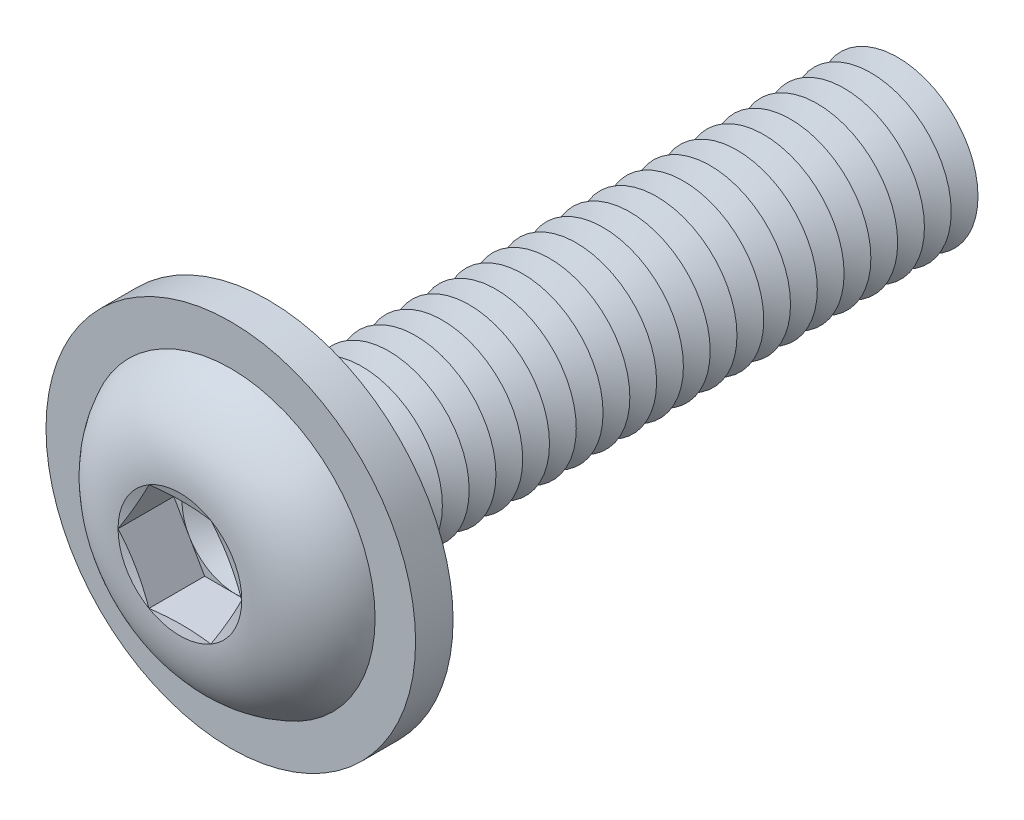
ISO-10303-21;
HEADER;
FILE_DESCRIPTION(('STEP AP214'),'2;1');
FILE_NAME('part.step','',(''),(''),'','','');
FILE_SCHEMA(('AUTOMOTIVE_DESIGN { 1 0 10303 214 1 1 1 1 }'));
ENDSEC;
DATA;
#1=APPLICATION_CONTEXT('core data for automotive mechanical design processes');
#2=APPLICATION_PROTOCOL_DEFINITION('international standard','automotive_design',2000,#1);
#3=PRODUCT_CONTEXT('',#1,'mechanical');
#4=PRODUCT('Part','Part','',(#3));
#5=PRODUCT_RELATED_PRODUCT_CATEGORY('part','',(#4));
#6=PRODUCT_DEFINITION_FORMATION('','',#4);
#7=PRODUCT_DEFINITION_CONTEXT('part definition',#1,'design');
#8=PRODUCT_DEFINITION('design','',#6,#7);
#9=PRODUCT_DEFINITION_SHAPE('','',#8);
#10=(LENGTH_UNIT() NAMED_UNIT(*) SI_UNIT(.MILLI.,.METRE.));
#11=(NAMED_UNIT(*) PLANE_ANGLE_UNIT() SI_UNIT($,.RADIAN.));
#12=(NAMED_UNIT(*) SI_UNIT($,.STERADIAN.) SOLID_ANGLE_UNIT());
#13=UNCERTAINTY_MEASURE_WITH_UNIT(LENGTH_MEASURE(1.E-05),#10,'distance_accuracy_value','');
#14=(GEOMETRIC_REPRESENTATION_CONTEXT(3) GLOBAL_UNCERTAINTY_ASSIGNED_CONTEXT((#13)) GLOBAL_UNIT_ASSIGNED_CONTEXT((#10,
#11,#12)) REPRESENTATION_CONTEXT('',''));
#15=CARTESIAN_POINT('',(0.,0.,0.));
#16=DIRECTION('',(0.,0.,1.));
#17=DIRECTION('',(1.,0.,0.));
#18=AXIS2_PLACEMENT_3D('',#15,#16,#17);
#19=CARTESIAN_POINT('',(0.,0.,-10.25));
#20=DIRECTION('',(0.,0.,1.));
#21=DIRECTION('',(1.,0.,0.));
#22=AXIS2_PLACEMENT_3D('',#19,#20,#21);
#23=CONICAL_SURFACE('',#22,1.5,1.0471975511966);
#24=CARTESIAN_POINT('',(0.,0.,-10.5));
#25=DIRECTION('',(0.,0.,1.));
#26=DIRECTION('',(1.,0.,0.));
#27=AXIS2_PLACEMENT_3D('',#24,#25,#26);
#28=CIRCLE('',#27,1.06698729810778);
#29=CARTESIAN_POINT('',(1.06698729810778,0.,-10.5));
#30=VERTEX_POINT('',#29);
#31=EDGE_CURVE('E402',#30,#30,#28,.T.);
#32=ORIENTED_EDGE('',*,*,#31,.T.);
#33=EDGE_LOOP('',(#32));
#34=FACE_BOUND('',#33,.T.);
#35=CARTESIAN_POINT('',(0.,0.,-10.25));
#36=DIRECTION('',(0.,0.,1.));
#37=DIRECTION('',(1.,0.,0.));
#38=AXIS2_PLACEMENT_3D('',#35,#36,#37);
#39=CIRCLE('',#38,1.5);
#40=CARTESIAN_POINT('',(1.5,0.,-10.25));
#41=VERTEX_POINT('',#40);
#42=EDGE_CURVE('E398',#41,#41,#39,.T.);
#43=ORIENTED_EDGE('',*,*,#42,.F.);
#44=EDGE_LOOP('',(#43));
#45=FACE_BOUND('',#44,.T.);
#46=ADVANCED_FACE('F39',(#34,#45),#23,.T.);
#47=CARTESIAN_POINT('',(0.,0.,-10.5));
#48=DIRECTION('',(0.,0.,-1.));
#49=DIRECTION('',(-1.,0.,0.));
#50=AXIS2_PLACEMENT_3D('',#47,#48,#49);
#51=CONICAL_SURFACE('',#50,1.06698729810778,1.0471975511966);
#52=CARTESIAN_POINT('',(0.,0.,-10.75));
#53=DIRECTION('',(0.,0.,1.));
#54=DIRECTION('',(1.,0.,0.));
#55=AXIS2_PLACEMENT_3D('',#52,#53,#54);
#56=CIRCLE('',#55,1.5);
#57=CARTESIAN_POINT('',(1.5,0.,-10.75));
#58=VERTEX_POINT('',#57);
#59=EDGE_CURVE('E406',#58,#58,#56,.T.);
#60=ORIENTED_EDGE('',*,*,#59,.T.);
#61=EDGE_LOOP('',(#60));
#62=FACE_BOUND('',#61,.T.);
#63=ORIENTED_EDGE('',*,*,#31,.F.);
#64=EDGE_LOOP('',(#63));
#65=FACE_BOUND('',#64,.T.);
#66=ADVANCED_FACE('F525',(#62,#65),#51,.T.);
#67=CARTESIAN_POINT('',(0.,1.50000000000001,-12.));
#68=DIRECTION('',(0.,0.,-1.));
#69=DIRECTION('',(-1.,0.,0.));
#70=AXIS2_PLACEMENT_3D('',#67,#68,#69);
#71=PLANE('',#70);
#72=CARTESIAN_POINT('',(0.,0.,-12.));
#73=DIRECTION('',(0.,0.,1.));
#74=DIRECTION('',(1.,0.,0.));
#75=AXIS2_PLACEMENT_3D('',#72,#73,#74);
#76=CIRCLE('',#75,1.06698729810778);
#77=CARTESIAN_POINT('',(1.06698729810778,0.,-12.));
#78=VERTEX_POINT('',#77);
#79=EDGE_CURVE('E426',#78,#78,#76,.T.);
#80=ORIENTED_EDGE('',*,*,#79,.F.);
#81=EDGE_LOOP('',(#80));
#82=FACE_BOUND('',#81,.T.);
#83=ADVANCED_FACE('F531',(#82),#71,.T.);
#84=CARTESIAN_POINT('',(0.,0.,-11.75));
#85=DIRECTION('',(0.,0.,1.));
#86=DIRECTION('',(1.,0.,0.));
#87=AXIS2_PLACEMENT_3D('',#84,#85,#86);
#88=CONICAL_SURFACE('',#87,1.5,1.0471975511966);
#89=ORIENTED_EDGE('',*,*,#79,.T.);
#90=EDGE_LOOP('',(#89));
#91=FACE_BOUND('',#90,.T.);
#92=CARTESIAN_POINT('',(0.,0.,-11.75));
#93=DIRECTION('',(0.,0.,1.));
#94=DIRECTION('',(1.,0.,0.));
#95=AXIS2_PLACEMENT_3D('',#92,#93,#94);
#96=CIRCLE('',#95,1.5);
#97=CARTESIAN_POINT('',(1.5,0.,-11.75));
#98=VERTEX_POINT('',#97);
#99=EDGE_CURVE('E422',#98,#98,#96,.T.);
#100=ORIENTED_EDGE('',*,*,#99,.F.);
#101=EDGE_LOOP('',(#100));
#102=FACE_BOUND('',#101,.T.);
#103=ADVANCED_FACE('F550',(#91,#102),#88,.T.);
#104=CARTESIAN_POINT('',(0.,0.,-11.5));
#105=DIRECTION('',(0.,0.,-1.));
#106=DIRECTION('',(-1.,0.,0.));
#107=AXIS2_PLACEMENT_3D('',#104,#105,#106);
#108=CONICAL_SURFACE('',#107,1.06698729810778,1.0471975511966);
#109=ORIENTED_EDGE('',*,*,#99,.T.);
#110=EDGE_LOOP('',(#109));
#111=FACE_BOUND('',#110,.T.);
#112=CARTESIAN_POINT('',(0.,0.,-11.5));
#113=DIRECTION('',(0.,0.,1.));
#114=DIRECTION('',(1.,0.,0.));
#115=AXIS2_PLACEMENT_3D('',#112,#113,#114);
#116=CIRCLE('',#115,1.06698729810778);
#117=CARTESIAN_POINT('',(1.06698729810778,0.,-11.5));
#118=VERTEX_POINT('',#117);
#119=EDGE_CURVE('E418',#118,#118,#116,.T.);
#120=ORIENTED_EDGE('',*,*,#119,.F.);
#121=EDGE_LOOP('',(#120));
#122=FACE_BOUND('',#121,.T.);
#123=ADVANCED_FACE('F547',(#111,#122),#108,.T.);
#124=CARTESIAN_POINT('',(0.,0.,-11.25));
#125=DIRECTION('',(0.,0.,1.));
#126=DIRECTION('',(1.,0.,0.));
#127=AXIS2_PLACEMENT_3D('',#124,#125,#126);
#128=CONICAL_SURFACE('',#127,1.5,1.0471975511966);
#129=ORIENTED_EDGE('',*,*,#119,.T.);
#130=EDGE_LOOP('',(#129));
#131=FACE_BOUND('',#130,.T.);
#132=CARTESIAN_POINT('',(0.,0.,-11.25));
#133=DIRECTION('',(0.,0.,1.));
#134=DIRECTION('',(1.,0.,0.));
#135=AXIS2_PLACEMENT_3D('',#132,#133,#134);
#136=CIRCLE('',#135,1.5);
#137=CARTESIAN_POINT('',(1.5,0.,-11.25));
#138=VERTEX_POINT('',#137);
#139=EDGE_CURVE('E414',#138,#138,#136,.T.);
#140=ORIENTED_EDGE('',*,*,#139,.F.);
#141=EDGE_LOOP('',(#140));
#142=FACE_BOUND('',#141,.T.);
#143=ADVANCED_FACE('F541',(#131,#142),#128,.T.);
#144=CARTESIAN_POINT('',(0.,0.,-11.));
#145=DIRECTION('',(0.,0.,-1.));
#146=DIRECTION('',(-1.,0.,0.));
#147=AXIS2_PLACEMENT_3D('',#144,#145,#146);
#148=CONICAL_SURFACE('',#147,1.06698729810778,1.0471975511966);
#149=ORIENTED_EDGE('',*,*,#139,.T.);
#150=EDGE_LOOP('',(#149));
#151=FACE_BOUND('',#150,.T.);
#152=CARTESIAN_POINT('',(0.,0.,-11.));
#153=DIRECTION('',(0.,0.,1.));
#154=DIRECTION('',(1.,0.,0.));
#155=AXIS2_PLACEMENT_3D('',#152,#153,#154);
#156=CIRCLE('',#155,1.06698729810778);
#157=CARTESIAN_POINT('',(1.06698729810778,0.,-11.));
#158=VERTEX_POINT('',#157);
#159=EDGE_CURVE('E410',#158,#158,#156,.T.);
#160=ORIENTED_EDGE('',*,*,#159,.F.);
#161=EDGE_LOOP('',(#160));
#162=FACE_BOUND('',#161,.T.);
#163=ADVANCED_FACE('F537',(#151,#162),#148,.T.);
#164=CARTESIAN_POINT('',(0.,0.,-10.75));
#165=DIRECTION('',(0.,0.,1.));
#166=DIRECTION('',(1.,0.,0.));
#167=AXIS2_PLACEMENT_3D('',#164,#165,#166);
#168=CONICAL_SURFACE('',#167,1.5,1.0471975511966);
#169=ORIENTED_EDGE('',*,*,#159,.T.);
#170=EDGE_LOOP('',(#169));
#171=FACE_BOUND('',#170,.T.);
#172=ORIENTED_EDGE('',*,*,#59,.F.);
#173=EDGE_LOOP('',(#172));
#174=FACE_BOUND('',#173,.T.);
#175=ADVANCED_FACE('F540',(#171,#174),#168,.T.);
#176=CARTESIAN_POINT('',(0.,0.,-9.75));
#177=DIRECTION('',(0.,0.,1.));
#178=DIRECTION('',(1.,0.,0.));
#179=AXIS2_PLACEMENT_3D('',#176,#177,#178);
#180=CONICAL_SURFACE('',#179,1.5,1.0471975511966);
#181=CARTESIAN_POINT('',(0.,0.,-10.));
#182=DIRECTION('',(0.,0.,1.));
#183=DIRECTION('',(1.,0.,0.));
#184=AXIS2_PLACEMENT_3D('',#181,#182,#183);
#185=CIRCLE('',#184,1.06698729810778);
#186=CARTESIAN_POINT('',(1.06698729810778,0.,-10.));
#187=VERTEX_POINT('',#186);
#188=EDGE_CURVE('E394',#187,#187,#185,.T.);
#189=ORIENTED_EDGE('',*,*,#188,.T.);
#190=EDGE_LOOP('',(#189));
#191=FACE_BOUND('',#190,.T.);
#192=CARTESIAN_POINT('',(0.,0.,-9.75));
#193=DIRECTION('',(0.,0.,1.));
#194=DIRECTION('',(1.,0.,0.));
#195=AXIS2_PLACEMENT_3D('',#192,#193,#194);
#196=CIRCLE('',#195,1.5);
#197=CARTESIAN_POINT('',(1.5,0.,-9.75));
#198=VERTEX_POINT('',#197);
#199=EDGE_CURVE('E390',#198,#198,#196,.T.);
#200=ORIENTED_EDGE('',*,*,#199,.F.);
#201=EDGE_LOOP('',(#200));
#202=FACE_BOUND('',#201,.T.);
#203=ADVANCED_FACE('F545',(#191,#202),#180,.T.);
#204=CARTESIAN_POINT('',(0.,0.,-10.));
#205=DIRECTION('',(0.,0.,-1.));
#206=DIRECTION('',(-1.,0.,0.));
#207=AXIS2_PLACEMENT_3D('',#204,#205,#206);
#208=CONICAL_SURFACE('',#207,1.06698729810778,1.0471975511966);
#209=ORIENTED_EDGE('',*,*,#42,.T.);
#210=EDGE_LOOP('',(#209));
#211=FACE_BOUND('',#210,.T.);
#212=ORIENTED_EDGE('',*,*,#188,.F.);
#213=EDGE_LOOP('',(#212));
#214=FACE_BOUND('',#213,.T.);
#215=ADVANCED_FACE('F596',(#211,#214),#208,.T.);
#216=CARTESIAN_POINT('',(0.,0.,-9.25));
#217=DIRECTION('',(0.,0.,1.));
#218=DIRECTION('',(1.,0.,0.));
#219=AXIS2_PLACEMENT_3D('',#216,#217,#218);
#220=CONICAL_SURFACE('',#219,1.5,1.0471975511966);
#221=CARTESIAN_POINT('',(0.,0.,-9.5));
#222=DIRECTION('',(0.,0.,1.));
#223=DIRECTION('',(1.,0.,0.));
#224=AXIS2_PLACEMENT_3D('',#221,#222,#223);
#225=CIRCLE('',#224,1.06698729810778);
#226=CARTESIAN_POINT('',(1.06698729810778,0.,-9.5));
#227=VERTEX_POINT('',#226);
#228=EDGE_CURVE('E386',#227,#227,#225,.T.);
#229=ORIENTED_EDGE('',*,*,#228,.T.);
#230=EDGE_LOOP('',(#229));
#231=FACE_BOUND('',#230,.T.);
#232=CARTESIAN_POINT('',(0.,0.,-9.25));
#233=DIRECTION('',(0.,0.,1.));
#234=DIRECTION('',(1.,0.,0.));
#235=AXIS2_PLACEMENT_3D('',#232,#233,#234);
#236=CIRCLE('',#235,1.5);
#237=CARTESIAN_POINT('',(1.5,0.,-9.25));
#238=VERTEX_POINT('',#237);
#239=EDGE_CURVE('E382',#238,#238,#236,.T.);
#240=ORIENTED_EDGE('',*,*,#239,.F.);
#241=EDGE_LOOP('',(#240));
#242=FACE_BOUND('',#241,.T.);
#243=ADVANCED_FACE('F602',(#231,#242),#220,.T.);
#244=CARTESIAN_POINT('',(0.,0.,-9.5));
#245=DIRECTION('',(0.,0.,-1.));
#246=DIRECTION('',(-1.,0.,0.));
#247=AXIS2_PLACEMENT_3D('',#244,#245,#246);
#248=CONICAL_SURFACE('',#247,1.06698729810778,1.0471975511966);
#249=ORIENTED_EDGE('',*,*,#199,.T.);
#250=EDGE_LOOP('',(#249));
#251=FACE_BOUND('',#250,.T.);
#252=ORIENTED_EDGE('',*,*,#228,.F.);
#253=EDGE_LOOP('',(#252));
#254=FACE_BOUND('',#253,.T.);
#255=ADVANCED_FACE('F609',(#251,#254),#248,.T.);
#256=CARTESIAN_POINT('',(0.,0.,-8.75));
#257=DIRECTION('',(0.,0.,1.));
#258=DIRECTION('',(1.,0.,0.));
#259=AXIS2_PLACEMENT_3D('',#256,#257,#258);
#260=CONICAL_SURFACE('',#259,1.5,1.0471975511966);
#261=CARTESIAN_POINT('',(0.,0.,-9.));
#262=DIRECTION('',(0.,0.,1.));
#263=DIRECTION('',(1.,0.,0.));
#264=AXIS2_PLACEMENT_3D('',#261,#262,#263);
#265=CIRCLE('',#264,1.06698729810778);
#266=CARTESIAN_POINT('',(1.06698729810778,0.,-9.));
#267=VERTEX_POINT('',#266);
#268=EDGE_CURVE('E378',#267,#267,#265,.T.);
#269=ORIENTED_EDGE('',*,*,#268,.T.);
#270=EDGE_LOOP('',(#269));
#271=FACE_BOUND('',#270,.T.);
#272=CARTESIAN_POINT('',(0.,0.,-8.75));
#273=DIRECTION('',(0.,0.,1.));
#274=DIRECTION('',(1.,0.,0.));
#275=AXIS2_PLACEMENT_3D('',#272,#273,#274);
#276=CIRCLE('',#275,1.5);
#277=CARTESIAN_POINT('',(1.5,0.,-8.75));
#278=VERTEX_POINT('',#277);
#279=EDGE_CURVE('E374',#278,#278,#276,.T.);
#280=ORIENTED_EDGE('',*,*,#279,.F.);
#281=EDGE_LOOP('',(#280));
#282=FACE_BOUND('',#281,.T.);
#283=ADVANCED_FACE('F616',(#271,#282),#260,.T.);
#284=CARTESIAN_POINT('',(0.,0.,-9.));
#285=DIRECTION('',(0.,0.,-1.));
#286=DIRECTION('',(-1.,0.,0.));
#287=AXIS2_PLACEMENT_3D('',#284,#285,#286);
#288=CONICAL_SURFACE('',#287,1.06698729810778,1.0471975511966);
#289=ORIENTED_EDGE('',*,*,#239,.T.);
#290=EDGE_LOOP('',(#289));
#291=FACE_BOUND('',#290,.T.);
#292=ORIENTED_EDGE('',*,*,#268,.F.);
#293=EDGE_LOOP('',(#292));
#294=FACE_BOUND('',#293,.T.);
#295=ADVANCED_FACE('F623',(#291,#294),#288,.T.);
#296=CARTESIAN_POINT('',(0.,0.,-8.25));
#297=DIRECTION('',(0.,0.,1.));
#298=DIRECTION('',(1.,0.,0.));
#299=AXIS2_PLACEMENT_3D('',#296,#297,#298);
#300=CONICAL_SURFACE('',#299,1.5,1.0471975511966);
#301=CARTESIAN_POINT('',(0.,0.,-8.5));
#302=DIRECTION('',(0.,0.,1.));
#303=DIRECTION('',(1.,0.,0.));
#304=AXIS2_PLACEMENT_3D('',#301,#302,#303);
#305=CIRCLE('',#304,1.06698729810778);
#306=CARTESIAN_POINT('',(1.06698729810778,0.,-8.5));
#307=VERTEX_POINT('',#306);
#308=EDGE_CURVE('E370',#307,#307,#305,.T.);
#309=ORIENTED_EDGE('',*,*,#308,.T.);
#310=EDGE_LOOP('',(#309));
#311=FACE_BOUND('',#310,.T.);
#312=CARTESIAN_POINT('',(0.,0.,-8.25));
#313=DIRECTION('',(0.,0.,1.));
#314=DIRECTION('',(1.,0.,0.));
#315=AXIS2_PLACEMENT_3D('',#312,#313,#314);
#316=CIRCLE('',#315,1.5);
#317=CARTESIAN_POINT('',(1.5,0.,-8.25));
#318=VERTEX_POINT('',#317);
#319=EDGE_CURVE('E366',#318,#318,#316,.T.);
#320=ORIENTED_EDGE('',*,*,#319,.F.);
#321=EDGE_LOOP('',(#320));
#322=FACE_BOUND('',#321,.T.);
#323=ADVANCED_FACE('F630',(#311,#322),#300,.T.);
#324=CARTESIAN_POINT('',(0.,0.,-8.5));
#325=DIRECTION('',(0.,0.,-1.));
#326=DIRECTION('',(-1.,0.,0.));
#327=AXIS2_PLACEMENT_3D('',#324,#325,#326);
#328=CONICAL_SURFACE('',#327,1.06698729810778,1.0471975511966);
#329=ORIENTED_EDGE('',*,*,#279,.T.);
#330=EDGE_LOOP('',(#329));
#331=FACE_BOUND('',#330,.T.);
#332=ORIENTED_EDGE('',*,*,#308,.F.);
#333=EDGE_LOOP('',(#332));
#334=FACE_BOUND('',#333,.T.);
#335=ADVANCED_FACE('F637',(#331,#334),#328,.T.);
#336=CARTESIAN_POINT('',(0.,0.,-7.75));
#337=DIRECTION('',(0.,0.,1.));
#338=DIRECTION('',(1.,0.,0.));
#339=AXIS2_PLACEMENT_3D('',#336,#337,#338);
#340=CONICAL_SURFACE('',#339,1.5,1.0471975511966);
#341=CARTESIAN_POINT('',(0.,0.,-8.));
#342=DIRECTION('',(0.,0.,1.));
#343=DIRECTION('',(1.,0.,0.));
#344=AXIS2_PLACEMENT_3D('',#341,#342,#343);
#345=CIRCLE('',#344,1.06698729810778);
#346=CARTESIAN_POINT('',(1.06698729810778,0.,-8.));
#347=VERTEX_POINT('',#346);
#348=EDGE_CURVE('E362',#347,#347,#345,.T.);
#349=ORIENTED_EDGE('',*,*,#348,.T.);
#350=EDGE_LOOP('',(#349));
#351=FACE_BOUND('',#350,.T.);
#352=CARTESIAN_POINT('',(0.,0.,-7.75));
#353=DIRECTION('',(0.,0.,1.));
#354=DIRECTION('',(1.,0.,0.));
#355=AXIS2_PLACEMENT_3D('',#352,#353,#354);
#356=CIRCLE('',#355,1.5);
#357=CARTESIAN_POINT('',(1.5,0.,-7.75));
#358=VERTEX_POINT('',#357);
#359=EDGE_CURVE('E358',#358,#358,#356,.T.);
#360=ORIENTED_EDGE('',*,*,#359,.F.);
#361=EDGE_LOOP('',(#360));
#362=FACE_BOUND('',#361,.T.);
#363=ADVANCED_FACE('F644',(#351,#362),#340,.T.);
#364=CARTESIAN_POINT('',(0.,0.,-8.));
#365=DIRECTION('',(0.,0.,-1.));
#366=DIRECTION('',(-1.,0.,0.));
#367=AXIS2_PLACEMENT_3D('',#364,#365,#366);
#368=CONICAL_SURFACE('',#367,1.06698729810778,1.0471975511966);
#369=ORIENTED_EDGE('',*,*,#319,.T.);
#370=EDGE_LOOP('',(#369));
#371=FACE_BOUND('',#370,.T.);
#372=ORIENTED_EDGE('',*,*,#348,.F.);
#373=EDGE_LOOP('',(#372));
#374=FACE_BOUND('',#373,.T.);
#375=ADVANCED_FACE('F651',(#371,#374),#368,.T.);
#376=CARTESIAN_POINT('',(0.,0.,-7.25));
#377=DIRECTION('',(0.,0.,1.));
#378=DIRECTION('',(1.,0.,0.));
#379=AXIS2_PLACEMENT_3D('',#376,#377,#378);
#380=CONICAL_SURFACE('',#379,1.5,1.0471975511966);
#381=CARTESIAN_POINT('',(0.,0.,-7.5));
#382=DIRECTION('',(0.,0.,1.));
#383=DIRECTION('',(1.,0.,0.));
#384=AXIS2_PLACEMENT_3D('',#381,#382,#383);
#385=CIRCLE('',#384,1.06698729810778);
#386=CARTESIAN_POINT('',(1.06698729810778,0.,-7.5));
#387=VERTEX_POINT('',#386);
#388=EDGE_CURVE('E354',#387,#387,#385,.T.);
#389=ORIENTED_EDGE('',*,*,#388,.T.);
#390=EDGE_LOOP('',(#389));
#391=FACE_BOUND('',#390,.T.);
#392=CARTESIAN_POINT('',(0.,0.,-7.25));
#393=DIRECTION('',(0.,0.,1.));
#394=DIRECTION('',(1.,0.,0.));
#395=AXIS2_PLACEMENT_3D('',#392,#393,#394);
#396=CIRCLE('',#395,1.5);
#397=CARTESIAN_POINT('',(1.5,0.,-7.25));
#398=VERTEX_POINT('',#397);
#399=EDGE_CURVE('E350',#398,#398,#396,.T.);
#400=ORIENTED_EDGE('',*,*,#399,.F.);
#401=EDGE_LOOP('',(#400));
#402=FACE_BOUND('',#401,.T.);
#403=ADVANCED_FACE('F658',(#391,#402),#380,.T.);
#404=CARTESIAN_POINT('',(0.,0.,-7.5));
#405=DIRECTION('',(0.,0.,-1.));
#406=DIRECTION('',(-1.,0.,0.));
#407=AXIS2_PLACEMENT_3D('',#404,#405,#406);
#408=CONICAL_SURFACE('',#407,1.06698729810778,1.0471975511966);
#409=ORIENTED_EDGE('',*,*,#359,.T.);
#410=EDGE_LOOP('',(#409));
#411=FACE_BOUND('',#410,.T.);
#412=ORIENTED_EDGE('',*,*,#388,.F.);
#413=EDGE_LOOP('',(#412));
#414=FACE_BOUND('',#413,.T.);
#415=ADVANCED_FACE('F665',(#411,#414),#408,.T.);
#416=CARTESIAN_POINT('',(0.,0.,-6.75));
#417=DIRECTION('',(0.,0.,1.));
#418=DIRECTION('',(1.,0.,0.));
#419=AXIS2_PLACEMENT_3D('',#416,#417,#418);
#420=CONICAL_SURFACE('',#419,1.5,1.0471975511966);
#421=CARTESIAN_POINT('',(0.,0.,-7.));
#422=DIRECTION('',(0.,0.,1.));
#423=DIRECTION('',(1.,0.,0.));
#424=AXIS2_PLACEMENT_3D('',#421,#422,#423);
#425=CIRCLE('',#424,1.06698729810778);
#426=CARTESIAN_POINT('',(1.06698729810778,0.,-7.));
#427=VERTEX_POINT('',#426);
#428=EDGE_CURVE('E346',#427,#427,#425,.T.);
#429=ORIENTED_EDGE('',*,*,#428,.T.);
#430=EDGE_LOOP('',(#429));
#431=FACE_BOUND('',#430,.T.);
#432=CARTESIAN_POINT('',(0.,0.,-6.75));
#433=DIRECTION('',(0.,0.,1.));
#434=DIRECTION('',(1.,0.,0.));
#435=AXIS2_PLACEMENT_3D('',#432,#433,#434);
#436=CIRCLE('',#435,1.5);
#437=CARTESIAN_POINT('',(1.5,0.,-6.75));
#438=VERTEX_POINT('',#437);
#439=EDGE_CURVE('E342',#438,#438,#436,.T.);
#440=ORIENTED_EDGE('',*,*,#439,.F.);
#441=EDGE_LOOP('',(#440));
#442=FACE_BOUND('',#441,.T.);
#443=ADVANCED_FACE('F672',(#431,#442),#420,.T.);
#444=CARTESIAN_POINT('',(0.,0.,-7.));
#445=DIRECTION('',(0.,0.,-1.));
#446=DIRECTION('',(-1.,0.,0.));
#447=AXIS2_PLACEMENT_3D('',#444,#445,#446);
#448=CONICAL_SURFACE('',#447,1.06698729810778,1.0471975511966);
#449=ORIENTED_EDGE('',*,*,#399,.T.);
#450=EDGE_LOOP('',(#449));
#451=FACE_BOUND('',#450,.T.);
#452=ORIENTED_EDGE('',*,*,#428,.F.);
#453=EDGE_LOOP('',(#452));
#454=FACE_BOUND('',#453,.T.);
#455=ADVANCED_FACE('F679',(#451,#454),#448,.T.);
#456=CARTESIAN_POINT('',(0.,0.,-6.25));
#457=DIRECTION('',(0.,0.,1.));
#458=DIRECTION('',(1.,0.,0.));
#459=AXIS2_PLACEMENT_3D('',#456,#457,#458);
#460=CONICAL_SURFACE('',#459,1.5,1.0471975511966);
#461=CARTESIAN_POINT('',(0.,0.,-6.5));
#462=DIRECTION('',(0.,0.,1.));
#463=DIRECTION('',(1.,0.,0.));
#464=AXIS2_PLACEMENT_3D('',#461,#462,#463);
#465=CIRCLE('',#464,1.06698729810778);
#466=CARTESIAN_POINT('',(1.06698729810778,0.,-6.5));
#467=VERTEX_POINT('',#466);
#468=EDGE_CURVE('E338',#467,#467,#465,.T.);
#469=ORIENTED_EDGE('',*,*,#468,.T.);
#470=EDGE_LOOP('',(#469));
#471=FACE_BOUND('',#470,.T.);
#472=CARTESIAN_POINT('',(0.,0.,-6.25));
#473=DIRECTION('',(0.,0.,1.));
#474=DIRECTION('',(1.,0.,0.));
#475=AXIS2_PLACEMENT_3D('',#472,#473,#474);
#476=CIRCLE('',#475,1.5);
#477=CARTESIAN_POINT('',(1.5,0.,-6.25));
#478=VERTEX_POINT('',#477);
#479=EDGE_CURVE('E334',#478,#478,#476,.T.);
#480=ORIENTED_EDGE('',*,*,#479,.F.);
#481=EDGE_LOOP('',(#480));
#482=FACE_BOUND('',#481,.T.);
#483=ADVANCED_FACE('F686',(#471,#482),#460,.T.);
#484=CARTESIAN_POINT('',(0.,0.,-6.5));
#485=DIRECTION('',(0.,0.,-1.));
#486=DIRECTION('',(-1.,0.,0.));
#487=AXIS2_PLACEMENT_3D('',#484,#485,#486);
#488=CONICAL_SURFACE('',#487,1.06698729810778,1.0471975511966);
#489=ORIENTED_EDGE('',*,*,#439,.T.);
#490=EDGE_LOOP('',(#489));
#491=FACE_BOUND('',#490,.T.);
#492=ORIENTED_EDGE('',*,*,#468,.F.);
#493=EDGE_LOOP('',(#492));
#494=FACE_BOUND('',#493,.T.);
#495=ADVANCED_FACE('F693',(#491,#494),#488,.T.);
#496=CARTESIAN_POINT('',(0.,0.,-5.75));
#497=DIRECTION('',(0.,0.,1.));
#498=DIRECTION('',(1.,0.,0.));
#499=AXIS2_PLACEMENT_3D('',#496,#497,#498);
#500=CONICAL_SURFACE('',#499,1.5,1.0471975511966);
#501=CARTESIAN_POINT('',(0.,0.,-6.));
#502=DIRECTION('',(0.,0.,1.));
#503=DIRECTION('',(1.,0.,0.));
#504=AXIS2_PLACEMENT_3D('',#501,#502,#503);
#505=CIRCLE('',#504,1.06698729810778);
#506=CARTESIAN_POINT('',(1.06698729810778,0.,-6.));
#507=VERTEX_POINT('',#506);
#508=EDGE_CURVE('E330',#507,#507,#505,.T.);
#509=ORIENTED_EDGE('',*,*,#508,.T.);
#510=EDGE_LOOP('',(#509));
#511=FACE_BOUND('',#510,.T.);
#512=CARTESIAN_POINT('',(0.,0.,-5.75));
#513=DIRECTION('',(0.,0.,1.));
#514=DIRECTION('',(1.,0.,0.));
#515=AXIS2_PLACEMENT_3D('',#512,#513,#514);
#516=CIRCLE('',#515,1.5);
#517=CARTESIAN_POINT('',(1.5,0.,-5.75));
#518=VERTEX_POINT('',#517);
#519=EDGE_CURVE('E326',#518,#518,#516,.T.);
#520=ORIENTED_EDGE('',*,*,#519,.F.);
#521=EDGE_LOOP('',(#520));
#522=FACE_BOUND('',#521,.T.);
#523=ADVANCED_FACE('F700',(#511,#522),#500,.T.);
#524=CARTESIAN_POINT('',(0.,0.,-6.));
#525=DIRECTION('',(0.,0.,-1.));
#526=DIRECTION('',(-1.,0.,0.));
#527=AXIS2_PLACEMENT_3D('',#524,#525,#526);
#528=CONICAL_SURFACE('',#527,1.06698729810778,1.0471975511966);
#529=ORIENTED_EDGE('',*,*,#479,.T.);
#530=EDGE_LOOP('',(#529));
#531=FACE_BOUND('',#530,.T.);
#532=ORIENTED_EDGE('',*,*,#508,.F.);
#533=EDGE_LOOP('',(#532));
#534=FACE_BOUND('',#533,.T.);
#535=ADVANCED_FACE('F707',(#531,#534),#528,.T.);
#536=CARTESIAN_POINT('',(0.,0.,-5.25));
#537=DIRECTION('',(0.,0.,1.));
#538=DIRECTION('',(1.,0.,0.));
#539=AXIS2_PLACEMENT_3D('',#536,#537,#538);
#540=CONICAL_SURFACE('',#539,1.5,1.0471975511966);
#541=CARTESIAN_POINT('',(0.,0.,-5.5));
#542=DIRECTION('',(0.,0.,1.));
#543=DIRECTION('',(1.,0.,0.));
#544=AXIS2_PLACEMENT_3D('',#541,#542,#543);
#545=CIRCLE('',#544,1.06698729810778);
#546=CARTESIAN_POINT('',(1.06698729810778,0.,-5.5));
#547=VERTEX_POINT('',#546);
#548=EDGE_CURVE('E322',#547,#547,#545,.T.);
#549=ORIENTED_EDGE('',*,*,#548,.T.);
#550=EDGE_LOOP('',(#549));
#551=FACE_BOUND('',#550,.T.);
#552=CARTESIAN_POINT('',(0.,0.,-5.25));
#553=DIRECTION('',(0.,0.,1.));
#554=DIRECTION('',(1.,0.,0.));
#555=AXIS2_PLACEMENT_3D('',#552,#553,#554);
#556=CIRCLE('',#555,1.5);
#557=CARTESIAN_POINT('',(1.5,0.,-5.25));
#558=VERTEX_POINT('',#557);
#559=EDGE_CURVE('E318',#558,#558,#556,.T.);
#560=ORIENTED_EDGE('',*,*,#559,.F.);
#561=EDGE_LOOP('',(#560));
#562=FACE_BOUND('',#561,.T.);
#563=ADVANCED_FACE('F714',(#551,#562),#540,.T.);
#564=CARTESIAN_POINT('',(0.,0.,-5.5));
#565=DIRECTION('',(0.,0.,-1.));
#566=DIRECTION('',(-1.,0.,0.));
#567=AXIS2_PLACEMENT_3D('',#564,#565,#566);
#568=CONICAL_SURFACE('',#567,1.06698729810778,1.0471975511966);
#569=ORIENTED_EDGE('',*,*,#519,.T.);
#570=EDGE_LOOP('',(#569));
#571=FACE_BOUND('',#570,.T.);
#572=ORIENTED_EDGE('',*,*,#548,.F.);
#573=EDGE_LOOP('',(#572));
#574=FACE_BOUND('',#573,.T.);
#575=ADVANCED_FACE('F721',(#571,#574),#568,.T.);
#576=CARTESIAN_POINT('',(0.,0.,-4.75));
#577=DIRECTION('',(0.,0.,1.));
#578=DIRECTION('',(1.,0.,0.));
#579=AXIS2_PLACEMENT_3D('',#576,#577,#578);
#580=CONICAL_SURFACE('',#579,1.5,1.0471975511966);
#581=CARTESIAN_POINT('',(0.,0.,-5.));
#582=DIRECTION('',(0.,0.,1.));
#583=DIRECTION('',(1.,0.,0.));
#584=AXIS2_PLACEMENT_3D('',#581,#582,#583);
#585=CIRCLE('',#584,1.06698729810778);
#586=CARTESIAN_POINT('',(1.06698729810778,0.,-5.));
#587=VERTEX_POINT('',#586);
#588=EDGE_CURVE('E314',#587,#587,#585,.T.);
#589=ORIENTED_EDGE('',*,*,#588,.T.);
#590=EDGE_LOOP('',(#589));
#591=FACE_BOUND('',#590,.T.);
#592=CARTESIAN_POINT('',(0.,0.,-4.75));
#593=DIRECTION('',(0.,0.,1.));
#594=DIRECTION('',(1.,0.,0.));
#595=AXIS2_PLACEMENT_3D('',#592,#593,#594);
#596=CIRCLE('',#595,1.5);
#597=CARTESIAN_POINT('',(1.5,0.,-4.75));
#598=VERTEX_POINT('',#597);
#599=EDGE_CURVE('E310',#598,#598,#596,.T.);
#600=ORIENTED_EDGE('',*,*,#599,.F.);
#601=EDGE_LOOP('',(#600));
#602=FACE_BOUND('',#601,.T.);
#603=ADVANCED_FACE('F728',(#591,#602),#580,.T.);
#604=CARTESIAN_POINT('',(0.,0.,-5.));
#605=DIRECTION('',(0.,0.,-1.));
#606=DIRECTION('',(-1.,0.,0.));
#607=AXIS2_PLACEMENT_3D('',#604,#605,#606);
#608=CONICAL_SURFACE('',#607,1.06698729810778,1.0471975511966);
#609=ORIENTED_EDGE('',*,*,#559,.T.);
#610=EDGE_LOOP('',(#609));
#611=FACE_BOUND('',#610,.T.);
#612=ORIENTED_EDGE('',*,*,#588,.F.);
#613=EDGE_LOOP('',(#612));
#614=FACE_BOUND('',#613,.T.);
#615=ADVANCED_FACE('F735',(#611,#614),#608,.T.);
#616=CARTESIAN_POINT('',(0.,0.,-4.25));
#617=DIRECTION('',(0.,0.,1.));
#618=DIRECTION('',(1.,0.,0.));
#619=AXIS2_PLACEMENT_3D('',#616,#617,#618);
#620=CONICAL_SURFACE('',#619,1.5,1.0471975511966);
#621=CARTESIAN_POINT('',(0.,0.,-4.5));
#622=DIRECTION('',(0.,0.,1.));
#623=DIRECTION('',(1.,0.,0.));
#624=AXIS2_PLACEMENT_3D('',#621,#622,#623);
#625=CIRCLE('',#624,1.06698729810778);
#626=CARTESIAN_POINT('',(1.06698729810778,0.,-4.5));
#627=VERTEX_POINT('',#626);
#628=EDGE_CURVE('E306',#627,#627,#625,.T.);
#629=ORIENTED_EDGE('',*,*,#628,.T.);
#630=EDGE_LOOP('',(#629));
#631=FACE_BOUND('',#630,.T.);
#632=CARTESIAN_POINT('',(0.,0.,-4.25));
#633=DIRECTION('',(0.,0.,1.));
#634=DIRECTION('',(1.,0.,0.));
#635=AXIS2_PLACEMENT_3D('',#632,#633,#634);
#636=CIRCLE('',#635,1.5);
#637=CARTESIAN_POINT('',(1.5,0.,-4.25));
#638=VERTEX_POINT('',#637);
#639=EDGE_CURVE('E302',#638,#638,#636,.T.);
#640=ORIENTED_EDGE('',*,*,#639,.F.);
#641=EDGE_LOOP('',(#640));
#642=FACE_BOUND('',#641,.T.);
#643=ADVANCED_FACE('F742',(#631,#642),#620,.T.);
#644=CARTESIAN_POINT('',(0.,0.,-4.5));
#645=DIRECTION('',(0.,0.,-1.));
#646=DIRECTION('',(-1.,0.,0.));
#647=AXIS2_PLACEMENT_3D('',#644,#645,#646);
#648=CONICAL_SURFACE('',#647,1.06698729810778,1.0471975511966);
#649=ORIENTED_EDGE('',*,*,#599,.T.);
#650=EDGE_LOOP('',(#649));
#651=FACE_BOUND('',#650,.T.);
#652=ORIENTED_EDGE('',*,*,#628,.F.);
#653=EDGE_LOOP('',(#652));
#654=FACE_BOUND('',#653,.T.);
#655=ADVANCED_FACE('F749',(#651,#654),#648,.T.);
#656=CARTESIAN_POINT('',(0.,0.,-3.75));
#657=DIRECTION('',(0.,0.,1.));
#658=DIRECTION('',(1.,0.,0.));
#659=AXIS2_PLACEMENT_3D('',#656,#657,#658);
#660=CONICAL_SURFACE('',#659,1.5,1.0471975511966);
#661=CARTESIAN_POINT('',(0.,0.,-4.));
#662=DIRECTION('',(0.,0.,1.));
#663=DIRECTION('',(1.,0.,0.));
#664=AXIS2_PLACEMENT_3D('',#661,#662,#663);
#665=CIRCLE('',#664,1.06698729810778);
#666=CARTESIAN_POINT('',(1.06698729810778,0.,-4.));
#667=VERTEX_POINT('',#666);
#668=EDGE_CURVE('E298',#667,#667,#665,.T.);
#669=ORIENTED_EDGE('',*,*,#668,.T.);
#670=EDGE_LOOP('',(#669));
#671=FACE_BOUND('',#670,.T.);
#672=CARTESIAN_POINT('',(0.,0.,-3.75));
#673=DIRECTION('',(0.,0.,1.));
#674=DIRECTION('',(1.,0.,0.));
#675=AXIS2_PLACEMENT_3D('',#672,#673,#674);
#676=CIRCLE('',#675,1.5);
#677=CARTESIAN_POINT('',(1.5,0.,-3.75));
#678=VERTEX_POINT('',#677);
#679=EDGE_CURVE('E294',#678,#678,#676,.T.);
#680=ORIENTED_EDGE('',*,*,#679,.F.);
#681=EDGE_LOOP('',(#680));
#682=FACE_BOUND('',#681,.T.);
#683=ADVANCED_FACE('F756',(#671,#682),#660,.T.);
#684=CARTESIAN_POINT('',(0.,0.,-4.));
#685=DIRECTION('',(0.,0.,-1.));
#686=DIRECTION('',(-1.,0.,0.));
#687=AXIS2_PLACEMENT_3D('',#684,#685,#686);
#688=CONICAL_SURFACE('',#687,1.06698729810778,1.0471975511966);
#689=ORIENTED_EDGE('',*,*,#639,.T.);
#690=EDGE_LOOP('',(#689));
#691=FACE_BOUND('',#690,.T.);
#692=ORIENTED_EDGE('',*,*,#668,.F.);
#693=EDGE_LOOP('',(#692));
#694=FACE_BOUND('',#693,.T.);
#695=ADVANCED_FACE('F763',(#691,#694),#688,.T.);
#696=CARTESIAN_POINT('',(0.,0.,-3.25));
#697=DIRECTION('',(0.,0.,1.));
#698=DIRECTION('',(1.,0.,0.));
#699=AXIS2_PLACEMENT_3D('',#696,#697,#698);
#700=CONICAL_SURFACE('',#699,1.5,1.0471975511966);
#701=CARTESIAN_POINT('',(0.,0.,-3.5));
#702=DIRECTION('',(0.,0.,1.));
#703=DIRECTION('',(1.,0.,0.));
#704=AXIS2_PLACEMENT_3D('',#701,#702,#703);
#705=CIRCLE('',#704,1.06698729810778);
#706=CARTESIAN_POINT('',(1.06698729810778,0.,-3.5));
#707=VERTEX_POINT('',#706);
#708=EDGE_CURVE('E290',#707,#707,#705,.T.);
#709=ORIENTED_EDGE('',*,*,#708,.T.);
#710=EDGE_LOOP('',(#709));
#711=FACE_BOUND('',#710,.T.);
#712=CARTESIAN_POINT('',(0.,0.,-3.25));
#713=DIRECTION('',(0.,0.,1.));
#714=DIRECTION('',(1.,0.,0.));
#715=AXIS2_PLACEMENT_3D('',#712,#713,#714);
#716=CIRCLE('',#715,1.5);
#717=CARTESIAN_POINT('',(1.5,0.,-3.25));
#718=VERTEX_POINT('',#717);
#719=EDGE_CURVE('E286',#718,#718,#716,.T.);
#720=ORIENTED_EDGE('',*,*,#719,.F.);
#721=EDGE_LOOP('',(#720));
#722=FACE_BOUND('',#721,.T.);
#723=ADVANCED_FACE('F770',(#711,#722),#700,.T.);
#724=CARTESIAN_POINT('',(0.,0.,-3.5));
#725=DIRECTION('',(0.,0.,-1.));
#726=DIRECTION('',(-1.,0.,0.));
#727=AXIS2_PLACEMENT_3D('',#724,#725,#726);
#728=CONICAL_SURFACE('',#727,1.06698729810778,1.0471975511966);
#729=ORIENTED_EDGE('',*,*,#679,.T.);
#730=EDGE_LOOP('',(#729));
#731=FACE_BOUND('',#730,.T.);
#732=ORIENTED_EDGE('',*,*,#708,.F.);
#733=EDGE_LOOP('',(#732));
#734=FACE_BOUND('',#733,.T.);
#735=ADVANCED_FACE('F777',(#731,#734),#728,.T.);
#736=CARTESIAN_POINT('',(0.,0.,-2.75));
#737=DIRECTION('',(0.,0.,1.));
#738=DIRECTION('',(1.,0.,0.));
#739=AXIS2_PLACEMENT_3D('',#736,#737,#738);
#740=CONICAL_SURFACE('',#739,1.5,1.0471975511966);
#741=CARTESIAN_POINT('',(0.,0.,-3.));
#742=DIRECTION('',(0.,0.,1.));
#743=DIRECTION('',(1.,0.,0.));
#744=AXIS2_PLACEMENT_3D('',#741,#742,#743);
#745=CIRCLE('',#744,1.06698729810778);
#746=CARTESIAN_POINT('',(1.06698729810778,0.,-3.));
#747=VERTEX_POINT('',#746);
#748=EDGE_CURVE('E282',#747,#747,#745,.T.);
#749=ORIENTED_EDGE('',*,*,#748,.T.);
#750=EDGE_LOOP('',(#749));
#751=FACE_BOUND('',#750,.T.);
#752=CARTESIAN_POINT('',(0.,0.,-2.75));
#753=DIRECTION('',(0.,0.,1.));
#754=DIRECTION('',(1.,0.,0.));
#755=AXIS2_PLACEMENT_3D('',#752,#753,#754);
#756=CIRCLE('',#755,1.5);
#757=CARTESIAN_POINT('',(1.5,0.,-2.75));
#758=VERTEX_POINT('',#757);
#759=EDGE_CURVE('E278',#758,#758,#756,.T.);
#760=ORIENTED_EDGE('',*,*,#759,.F.);
#761=EDGE_LOOP('',(#760));
#762=FACE_BOUND('',#761,.T.);
#763=ADVANCED_FACE('F784',(#751,#762),#740,.T.);
#764=CARTESIAN_POINT('',(0.,0.,-3.));
#765=DIRECTION('',(0.,0.,-1.));
#766=DIRECTION('',(-1.,0.,0.));
#767=AXIS2_PLACEMENT_3D('',#764,#765,#766);
#768=CONICAL_SURFACE('',#767,1.06698729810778,1.0471975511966);
#769=ORIENTED_EDGE('',*,*,#719,.T.);
#770=EDGE_LOOP('',(#769));
#771=FACE_BOUND('',#770,.T.);
#772=ORIENTED_EDGE('',*,*,#748,.F.);
#773=EDGE_LOOP('',(#772));
#774=FACE_BOUND('',#773,.T.);
#775=ADVANCED_FACE('F791',(#771,#774),#768,.T.);
#776=CARTESIAN_POINT('',(0.,0.,-2.25));
#777=DIRECTION('',(0.,0.,1.));
#778=DIRECTION('',(1.,0.,0.));
#779=AXIS2_PLACEMENT_3D('',#776,#777,#778);
#780=CONICAL_SURFACE('',#779,1.5,1.0471975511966);
#781=CARTESIAN_POINT('',(0.,0.,-2.5));
#782=DIRECTION('',(0.,0.,1.));
#783=DIRECTION('',(1.,0.,0.));
#784=AXIS2_PLACEMENT_3D('',#781,#782,#783);
#785=CIRCLE('',#784,1.06698729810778);
#786=CARTESIAN_POINT('',(1.06698729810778,0.,-2.5));
#787=VERTEX_POINT('',#786);
#788=EDGE_CURVE('E274',#787,#787,#785,.T.);
#789=ORIENTED_EDGE('',*,*,#788,.T.);
#790=EDGE_LOOP('',(#789));
#791=FACE_BOUND('',#790,.T.);
#792=CARTESIAN_POINT('',(0.,0.,-2.25));
#793=DIRECTION('',(0.,0.,1.));
#794=DIRECTION('',(1.,0.,0.));
#795=AXIS2_PLACEMENT_3D('',#792,#793,#794);
#796=CIRCLE('',#795,1.5);
#797=CARTESIAN_POINT('',(1.5,0.,-2.25));
#798=VERTEX_POINT('',#797);
#799=EDGE_CURVE('E270',#798,#798,#796,.T.);
#800=ORIENTED_EDGE('',*,*,#799,.F.);
#801=EDGE_LOOP('',(#800));
#802=FACE_BOUND('',#801,.T.);
#803=ADVANCED_FACE('F798',(#791,#802),#780,.T.);
#804=CARTESIAN_POINT('',(0.,0.,-2.5));
#805=DIRECTION('',(0.,0.,-1.));
#806=DIRECTION('',(-1.,0.,0.));
#807=AXIS2_PLACEMENT_3D('',#804,#805,#806);
#808=CONICAL_SURFACE('',#807,1.06698729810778,1.0471975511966);
#809=ORIENTED_EDGE('',*,*,#759,.T.);
#810=EDGE_LOOP('',(#809));
#811=FACE_BOUND('',#810,.T.);
#812=ORIENTED_EDGE('',*,*,#788,.F.);
#813=EDGE_LOOP('',(#812));
#814=FACE_BOUND('',#813,.T.);
#815=ADVANCED_FACE('F805',(#811,#814),#808,.T.);
#816=CARTESIAN_POINT('',(0.,0.,-1.75));
#817=DIRECTION('',(0.,0.,1.));
#818=DIRECTION('',(1.,0.,0.));
#819=AXIS2_PLACEMENT_3D('',#816,#817,#818);
#820=CONICAL_SURFACE('',#819,1.5,1.0471975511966);
#821=CARTESIAN_POINT('',(0.,0.,-2.));
#822=DIRECTION('',(0.,0.,1.));
#823=DIRECTION('',(1.,0.,0.));
#824=AXIS2_PLACEMENT_3D('',#821,#822,#823);
#825=CIRCLE('',#824,1.06698729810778);
#826=CARTESIAN_POINT('',(1.06698729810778,0.,-2.));
#827=VERTEX_POINT('',#826);
#828=EDGE_CURVE('E266',#827,#827,#825,.T.);
#829=ORIENTED_EDGE('',*,*,#828,.T.);
#830=EDGE_LOOP('',(#829));
#831=FACE_BOUND('',#830,.T.);
#832=CARTESIAN_POINT('',(0.,0.,-1.75));
#833=DIRECTION('',(0.,0.,1.));
#834=DIRECTION('',(1.,0.,0.));
#835=AXIS2_PLACEMENT_3D('',#832,#833,#834);
#836=CIRCLE('',#835,1.5);
#837=CARTESIAN_POINT('',(1.5,0.,-1.75));
#838=VERTEX_POINT('',#837);
#839=EDGE_CURVE('E262',#838,#838,#836,.T.);
#840=ORIENTED_EDGE('',*,*,#839,.F.);
#841=EDGE_LOOP('',(#840));
#842=FACE_BOUND('',#841,.T.);
#843=ADVANCED_FACE('F812',(#831,#842),#820,.T.);
#844=CARTESIAN_POINT('',(0.,0.,-2.));
#845=DIRECTION('',(0.,0.,-1.));
#846=DIRECTION('',(-1.,0.,0.));
#847=AXIS2_PLACEMENT_3D('',#844,#845,#846);
#848=CONICAL_SURFACE('',#847,1.06698729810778,1.0471975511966);
#849=ORIENTED_EDGE('',*,*,#799,.T.);
#850=EDGE_LOOP('',(#849));
#851=FACE_BOUND('',#850,.T.);
#852=ORIENTED_EDGE('',*,*,#828,.F.);
#853=EDGE_LOOP('',(#852));
#854=FACE_BOUND('',#853,.T.);
#855=ADVANCED_FACE('F819',(#851,#854),#848,.T.);
#856=CARTESIAN_POINT('',(0.,0.,-1.25));
#857=DIRECTION('',(0.,0.,1.));
#858=DIRECTION('',(1.,0.,0.));
#859=AXIS2_PLACEMENT_3D('',#856,#857,#858);
#860=CONICAL_SURFACE('',#859,1.5,1.0471975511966);
#861=CARTESIAN_POINT('',(0.,0.,-1.5));
#862=DIRECTION('',(0.,0.,1.));
#863=DIRECTION('',(1.,0.,0.));
#864=AXIS2_PLACEMENT_3D('',#861,#862,#863);
#865=CIRCLE('',#864,1.06698729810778);
#866=CARTESIAN_POINT('',(1.06698729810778,0.,-1.5));
#867=VERTEX_POINT('',#866);
#868=EDGE_CURVE('E258',#867,#867,#865,.T.);
#869=ORIENTED_EDGE('',*,*,#868,.T.);
#870=EDGE_LOOP('',(#869));
#871=FACE_BOUND('',#870,.T.);
#872=CARTESIAN_POINT('',(0.,0.,-1.25));
#873=DIRECTION('',(0.,0.,1.));
#874=DIRECTION('',(1.,0.,0.));
#875=AXIS2_PLACEMENT_3D('',#872,#873,#874);
#876=CIRCLE('',#875,1.5);
#877=CARTESIAN_POINT('',(1.5,0.,-1.25));
#878=VERTEX_POINT('',#877);
#879=EDGE_CURVE('E254',#878,#878,#876,.T.);
#880=ORIENTED_EDGE('',*,*,#879,.F.);
#881=EDGE_LOOP('',(#880));
#882=FACE_BOUND('',#881,.T.);
#883=ADVANCED_FACE('F826',(#871,#882),#860,.T.);
#884=CARTESIAN_POINT('',(0.,0.,-1.5));
#885=DIRECTION('',(0.,0.,-1.));
#886=DIRECTION('',(-1.,0.,0.));
#887=AXIS2_PLACEMENT_3D('',#884,#885,#886);
#888=CONICAL_SURFACE('',#887,1.06698729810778,1.0471975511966);
#889=ORIENTED_EDGE('',*,*,#839,.T.);
#890=EDGE_LOOP('',(#889));
#891=FACE_BOUND('',#890,.T.);
#892=ORIENTED_EDGE('',*,*,#868,.F.);
#893=EDGE_LOOP('',(#892));
#894=FACE_BOUND('',#893,.T.);
#895=ADVANCED_FACE('F833',(#891,#894),#888,.T.);
#896=CARTESIAN_POINT('',(0.,0.,-0.750000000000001));
#897=DIRECTION('',(0.,0.,1.));
#898=DIRECTION('',(1.,0.,0.));
#899=AXIS2_PLACEMENT_3D('',#896,#897,#898);
#900=CONICAL_SURFACE('',#899,1.5,1.0471975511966);
#901=CARTESIAN_POINT('',(0.,0.,-1.));
#902=DIRECTION('',(0.,0.,1.));
#903=DIRECTION('',(1.,0.,0.));
#904=AXIS2_PLACEMENT_3D('',#901,#902,#903);
#905=CIRCLE('',#904,1.06698729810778);
#906=CARTESIAN_POINT('',(1.06698729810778,0.,-1.));
#907=VERTEX_POINT('',#906);
#908=EDGE_CURVE('E250',#907,#907,#905,.T.);
#909=ORIENTED_EDGE('',*,*,#908,.T.);
#910=EDGE_LOOP('',(#909));
#911=FACE_BOUND('',#910,.T.);
#912=CARTESIAN_POINT('',(0.,0.,-0.750000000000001));
#913=DIRECTION('',(0.,0.,1.));
#914=DIRECTION('',(1.,0.,0.));
#915=AXIS2_PLACEMENT_3D('',#912,#913,#914);
#916=CIRCLE('',#915,1.5);
#917=CARTESIAN_POINT('',(1.5,0.,-0.750000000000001));
#918=VERTEX_POINT('',#917);
#919=EDGE_CURVE('E242',#918,#918,#916,.T.);
#920=ORIENTED_EDGE('',*,*,#919,.F.);
#921=EDGE_LOOP('',(#920));
#922=FACE_BOUND('',#921,.T.);
#923=ADVANCED_FACE('F840',(#911,#922),#900,.T.);
#924=CARTESIAN_POINT('',(0.,0.,-1.));
#925=DIRECTION('',(0.,0.,-1.));
#926=DIRECTION('',(-1.,0.,0.));
#927=AXIS2_PLACEMENT_3D('',#924,#925,#926);
#928=CONICAL_SURFACE('',#927,1.06698729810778,1.0471975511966);
#929=ORIENTED_EDGE('',*,*,#879,.T.);
#930=EDGE_LOOP('',(#929));
#931=FACE_BOUND('',#930,.T.);
#932=ORIENTED_EDGE('',*,*,#908,.F.);
#933=EDGE_LOOP('',(#932));
#934=FACE_BOUND('',#933,.T.);
#935=ADVANCED_FACE('F847',(#931,#934),#928,.T.);
#936=CARTESIAN_POINT('',(0.,0.,-0.25));
#937=DIRECTION('',(0.,0.,1.));
#938=DIRECTION('',(1.,0.,0.));
#939=AXIS2_PLACEMENT_3D('',#936,#937,#938);
#940=CONICAL_SURFACE('',#939,1.5,1.0471975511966);
#941=CARTESIAN_POINT('',(0.,0.,-0.5));
#942=DIRECTION('',(0.,0.,1.));
#943=DIRECTION('',(1.,0.,0.));
#944=AXIS2_PLACEMENT_3D('',#941,#942,#943);
#945=CIRCLE('',#944,1.06698729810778);
#946=CARTESIAN_POINT('',(1.06698729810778,0.,-0.5));
#947=VERTEX_POINT('',#946);
#948=EDGE_CURVE('E231',#947,#947,#945,.T.);
#949=ORIENTED_EDGE('',*,*,#948,.T.);
#950=EDGE_LOOP('',(#949));
#951=FACE_BOUND('',#950,.T.);
#952=CARTESIAN_POINT('',(0.,0.,-0.25));
#953=DIRECTION('',(0.,0.,1.));
#954=DIRECTION('',(1.,0.,0.));
#955=AXIS2_PLACEMENT_3D('',#952,#953,#954);
#956=CIRCLE('',#955,1.5);
#957=CARTESIAN_POINT('',(1.5,0.,-0.25));
#958=VERTEX_POINT('',#957);
#959=EDGE_CURVE('E246',#958,#958,#956,.T.);
#960=ORIENTED_EDGE('',*,*,#959,.F.);
#961=EDGE_LOOP('',(#960));
#962=FACE_BOUND('',#961,.T.);
#963=ADVANCED_FACE('F854',(#951,#962),#940,.T.);
#964=CARTESIAN_POINT('',(0.,0.,-0.5));
#965=DIRECTION('',(0.,0.,-1.));
#966=DIRECTION('',(-1.,0.,0.));
#967=AXIS2_PLACEMENT_3D('',#964,#965,#966);
#968=CONICAL_SURFACE('',#967,1.06698729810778,1.0471975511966);
#969=ORIENTED_EDGE('',*,*,#919,.T.);
#970=EDGE_LOOP('',(#969));
#971=FACE_BOUND('',#970,.T.);
#972=ORIENTED_EDGE('',*,*,#948,.F.);
#973=EDGE_LOOP('',(#972));
#974=FACE_BOUND('',#973,.T.);
#975=ADVANCED_FACE('F220',(#971,#974),#968,.T.);
#976=CARTESIAN_POINT('',(0.,1.5,0.));
#977=DIRECTION('',(0.,0.,-1.));
#978=DIRECTION('',(-1.,0.,0.));
#979=AXIS2_PLACEMENT_3D('',#976,#977,#978);
#980=PLANE('',#979);
#981=CARTESIAN_POINT('',(0.,0.,0.));
#982=DIRECTION('',(0.,0.,-1.));
#983=DIRECTION('',(-1.,0.,0.));
#984=AXIS2_PLACEMENT_3D('',#981,#982,#983);
#985=CIRCLE('',#984,1.75);
#986=CARTESIAN_POINT('',(-1.75,0.,0.));
#987=VERTEX_POINT('',#986);
#988=EDGE_CURVE('E435',#987,#987,#985,.F.);
#989=ORIENTED_EDGE('',*,*,#988,.T.);
#990=EDGE_LOOP('',(#989));
#991=FACE_BOUND('',#990,.T.);
#992=CARTESIAN_POINT('',(0.,0.,0.));
#993=DIRECTION('',(0.,0.,-1.));
#994=DIRECTION('',(0.,1.,0.));
#995=AXIS2_PLACEMENT_3D('',#992,#993,#994);
#996=CIRCLE('',#995,3.45);
#997=CARTESIAN_POINT('',(0.,3.45,0.));
#998=VERTEX_POINT('',#997);
#999=EDGE_CURVE('E1271',#998,#998,#996,.T.);
#1000=ORIENTED_EDGE('',*,*,#999,.T.);
#1001=EDGE_LOOP('',(#1000));
#1002=FACE_BOUND('',#1001,.T.);
#1003=ADVANCED_FACE('F866',(#991,#1002),#980,.T.);
#1004=CARTESIAN_POINT('',(0.,0.,-0.25));
#1005=DIRECTION('',(0.,0.,-1.));
#1006=DIRECTION('',(-1.,0.,0.));
#1007=AXIS2_PLACEMENT_3D('',#1004,#1005,#1006);
#1008=TOROIDAL_SURFACE('',#1007,1.75,0.25);
#1009=ORIENTED_EDGE('',*,*,#988,.F.);
#1010=EDGE_LOOP('',(#1009));
#1011=FACE_BOUND('',#1010,.T.);
#1012=ORIENTED_EDGE('',*,*,#959,.T.);
#1013=EDGE_LOOP('',(#1012));
#1014=FACE_BOUND('',#1013,.T.);
#1015=ADVANCED_FACE('F41',(#1011,#1014),#1008,.F.);
#1016=CARTESIAN_POINT('',(0.,0.,0.7));
#1017=DIRECTION('',(0.,0.,-1.));
#1018=DIRECTION('',(0.,1.,0.));
#1019=AXIS2_PLACEMENT_3D('',#1016,#1017,#1018);
#1020=CYLINDRICAL_SURFACE('',#1019,3.45);
#1021=CARTESIAN_POINT('',(0.,0.,0.7));
#1022=DIRECTION('',(0.,0.,-1.));
#1023=DIRECTION('',(0.,1.,0.));
#1024=AXIS2_PLACEMENT_3D('',#1021,#1022,#1023);
#1025=CIRCLE('',#1024,3.45);
#1026=CARTESIAN_POINT('',(0.,3.45,0.7));
#1027=VERTEX_POINT('',#1026);
#1028=EDGE_CURVE('E1273',#1027,#1027,#1025,.T.);
#1029=ORIENTED_EDGE('',*,*,#1028,.T.);
#1030=EDGE_LOOP('',(#1029));
#1031=FACE_BOUND('',#1030,.T.);
#1032=ORIENTED_EDGE('',*,*,#999,.F.);
#1033=EDGE_LOOP('',(#1032));
#1034=FACE_BOUND('',#1033,.T.);
#1035=ADVANCED_FACE('F877',(#1031,#1034),#1020,.T.);
#1036=CARTESIAN_POINT('',(0.,0.,0.7));
#1037=DIRECTION('',(0.,0.,-1.));
#1038=DIRECTION('',(0.,1.,0.));
#1039=AXIS2_PLACEMENT_3D('',#1036,#1037,#1038);
#1040=PLANE('',#1039);
#1041=CARTESIAN_POINT('',(0.,0.,0.7));
#1042=DIRECTION('',(0.,0.,-1.));
#1043=DIRECTION('',(0.,1.,0.));
#1044=AXIS2_PLACEMENT_3D('',#1041,#1042,#1043);
#1045=CIRCLE('',#1044,2.69421838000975);
#1046=CARTESIAN_POINT('',(0.,2.69421838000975,0.7));
#1047=VERTEX_POINT('',#1046);
#1048=EDGE_CURVE('E43',#1047,#1047,#1045,.F.);
#1049=ORIENTED_EDGE('',*,*,#1048,.F.);
#1050=EDGE_LOOP('',(#1049));
#1051=FACE_BOUND('',#1050,.T.);
#1052=ORIENTED_EDGE('',*,*,#1028,.F.);
#1053=EDGE_LOOP('',(#1052));
#1054=FACE_BOUND('',#1053,.T.);
#1055=ADVANCED_FACE('F117',(#1051,#1054),#1040,.F.);
#1056=CARTESIAN_POINT('',(0.,0.,0.609999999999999));
#1057=DIRECTION('',(0.,0.,1.));
#1058=DIRECTION('',(1.,0.,0.));
#1059=AXIS2_PLACEMENT_3D('',#1056,#1057,#1058);
#1060=CONICAL_SURFACE('',#1059,0.99999953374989,1.0471975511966);
#1061=CARTESIAN_POINT('',(0.,0.,0.0326500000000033));
#1062=VERTEX_POINT('',#1061);
#1063=VERTEX_LOOP('',#1062);
#1064=FACE_BOUND('',#1063,.T.);
#1065=CARTESIAN_POINT('',(0.,0.,0.609999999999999));
#1066=DIRECTION('',(0.,0.,1.));
#1067=DIRECTION('',(1.,0.,0.));
#1068=AXIS2_PLACEMENT_3D('',#1065,#1066,#1067);
#1069=CIRCLE('',#1068,0.99999953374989);
#1070=CARTESIAN_POINT('',(0.866024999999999,0.499999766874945,0.609999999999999));
#1071=VERTEX_POINT('',#1070);
#1072=CARTESIAN_POINT('',(0.,0.99999953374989,0.609999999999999));
#1073=VERTEX_POINT('',#1072);
#1074=EDGE_CURVE('E120',#1071,#1073,#1069,.T.);
#1075=ORIENTED_EDGE('',*,*,#1074,.T.);
#1076=CARTESIAN_POINT('',(0.,0.,0.609999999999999));
#1077=DIRECTION('',(0.,0.,1.));
#1078=DIRECTION('',(1.,0.,0.));
#1079=AXIS2_PLACEMENT_3D('',#1076,#1077,#1078);
#1080=CIRCLE('',#1079,0.99999953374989);
#1081=CARTESIAN_POINT('',(-0.866024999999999,0.499999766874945,0.609999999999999));
#1082=VERTEX_POINT('',#1081);
#1083=EDGE_CURVE('E11',#1073,#1082,#1080,.T.);
#1084=ORIENTED_EDGE('',*,*,#1083,.T.);
#1085=CARTESIAN_POINT('',(-0.866024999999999,-0.499999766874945,0.609999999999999));
#1086=VERTEX_POINT('',#1085);
#1087=EDGE_CURVE('E49',#1082,#1086,#1080,.T.);
#1088=ORIENTED_EDGE('',*,*,#1087,.T.);
#1089=CARTESIAN_POINT('',(0.,-0.99999953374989,0.609999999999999));
#1090=VERTEX_POINT('',#1089);
#1091=EDGE_CURVE('E441',#1086,#1090,#1080,.T.);
#1092=ORIENTED_EDGE('',*,*,#1091,.T.);
#1093=CARTESIAN_POINT('',(0.866024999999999,-0.499999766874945,0.609999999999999));
#1094=VERTEX_POINT('',#1093);
#1095=EDGE_CURVE('E57',#1090,#1094,#1080,.T.);
#1096=ORIENTED_EDGE('',*,*,#1095,.T.);
#1097=EDGE_CURVE('E50',#1094,#1071,#1080,.T.);
#1098=ORIENTED_EDGE('',*,*,#1097,.T.);
#1099=EDGE_LOOP('',(#1075,#1084,#1088,#1092,#1096,#1098));
#1100=FACE_BOUND('',#1099,.T.);
#1101=ADVANCED_FACE('F114',(#1064,#1100),#1060,.F.);
#1102=CARTESIAN_POINT('',(0.,0.,0.609999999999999));
#1103=DIRECTION('',(0.,0.,1.));
#1104=DIRECTION('',(1.,0.,0.));
#1105=AXIS2_PLACEMENT_3D('',#1102,#1103,#1104);
#1106=PLANE('',#1105);
#1107=ORIENTED_EDGE('',*,*,#1091,.F.);
#1108=DIRECTION('',(0.5,-0.866025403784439,0.));
#1109=VECTOR('',#1108,1.);
#1110=CARTESIAN_POINT('',(-1.1547,0.,0.609999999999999));
#1111=LINE('',#1110,#1109);
#1112=CARTESIAN_POINT('',(-0.577349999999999,-0.99999953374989,0.609999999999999));
#1113=VERTEX_POINT('',#1112);
#1114=EDGE_CURVE('E153',#1086,#1113,#1111,.T.);
#1115=ORIENTED_EDGE('',*,*,#1114,.T.);
#1116=DIRECTION('',(1.,0.,0.));
#1117=VECTOR('',#1116,1.);
#1118=CARTESIAN_POINT('',(-0.577349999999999,-0.99999953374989,0.609999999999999));
#1119=LINE('',#1118,#1117);
#1120=EDGE_CURVE('E159',#1113,#1090,#1119,.T.);
#1121=ORIENTED_EDGE('',*,*,#1120,.T.);
#1122=EDGE_LOOP('',(#1107,#1115,#1121));
#1123=FACE_BOUND('',#1122,.T.);
#1124=ADVANCED_FACE('F116',(#1123),#1106,.T.);
#1125=ORIENTED_EDGE('',*,*,#1095,.F.);
#1126=CARTESIAN_POINT('',(0.577349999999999,-0.99999953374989,0.609999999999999));
#1127=VERTEX_POINT('',#1126);
#1128=EDGE_CURVE('E158',#1090,#1127,#1119,.T.);
#1129=ORIENTED_EDGE('',*,*,#1128,.T.);
#1130=DIRECTION('',(0.5,0.866025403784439,0.));
#1131=VECTOR('',#1130,1.);
#1132=CARTESIAN_POINT('',(0.577349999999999,-0.99999953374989,0.609999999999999));
#1133=LINE('',#1132,#1131);
#1134=EDGE_CURVE('E164',#1127,#1094,#1133,.T.);
#1135=ORIENTED_EDGE('',*,*,#1134,.T.);
#1136=EDGE_LOOP('',(#1125,#1129,#1135));
#1137=FACE_BOUND('',#1136,.T.);
#1138=ADVANCED_FACE('F898',(#1137),#1106,.T.);
#1139=ORIENTED_EDGE('',*,*,#1097,.F.);
#1140=CARTESIAN_POINT('',(1.1547,0.,0.609999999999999));
#1141=VERTEX_POINT('',#1140);
#1142=EDGE_CURVE('E163',#1094,#1141,#1133,.T.);
#1143=ORIENTED_EDGE('',*,*,#1142,.T.);
#1144=DIRECTION('',(-0.5,0.866025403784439,0.));
#1145=VECTOR('',#1144,1.);
#1146=CARTESIAN_POINT('',(1.1547,0.,0.609999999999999));
#1147=LINE('',#1146,#1145);
#1148=EDGE_CURVE('E142',#1141,#1071,#1147,.T.);
#1149=ORIENTED_EDGE('',*,*,#1148,.T.);
#1150=EDGE_LOOP('',(#1139,#1143,#1149));
#1151=FACE_BOUND('',#1150,.T.);
#1152=ADVANCED_FACE('F903',(#1151),#1106,.T.);
#1153=ORIENTED_EDGE('',*,*,#1074,.F.);
#1154=CARTESIAN_POINT('',(0.577349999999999,0.99999953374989,0.609999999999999));
#1155=VERTEX_POINT('',#1154);
#1156=EDGE_CURVE('E127',#1071,#1155,#1147,.T.);
#1157=ORIENTED_EDGE('',*,*,#1156,.T.);
#1158=DIRECTION('',(-1.,0.,0.));
#1159=VECTOR('',#1158,1.);
#1160=CARTESIAN_POINT('',(0.577349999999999,0.99999953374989,0.609999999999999));
#1161=LINE('',#1160,#1159);
#1162=EDGE_CURVE('E138',#1155,#1073,#1161,.T.);
#1163=ORIENTED_EDGE('',*,*,#1162,.T.);
#1164=EDGE_LOOP('',(#1153,#1157,#1163));
#1165=FACE_BOUND('',#1164,.T.);
#1166=ADVANCED_FACE('F144',(#1165),#1106,.T.);
#1167=ORIENTED_EDGE('',*,*,#1083,.F.);
#1168=CARTESIAN_POINT('',(-0.577350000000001,0.999999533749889,0.609999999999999));
#1169=VERTEX_POINT('',#1168);
#1170=EDGE_CURVE('E133',#1073,#1169,#1161,.T.);
#1171=ORIENTED_EDGE('',*,*,#1170,.T.);
#1172=DIRECTION('',(-0.5,-0.866025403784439,0.));
#1173=VECTOR('',#1172,1.);
#1174=CARTESIAN_POINT('',(-0.577350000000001,0.999999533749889,0.609999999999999));
#1175=LINE('',#1174,#1173);
#1176=EDGE_CURVE('E136',#1169,#1082,#1175,.T.);
#1177=ORIENTED_EDGE('',*,*,#1176,.T.);
#1178=EDGE_LOOP('',(#1167,#1171,#1177));
#1179=FACE_BOUND('',#1178,.T.);
#1180=ADVANCED_FACE('F132',(#1179),#1106,.T.);
#1181=ORIENTED_EDGE('',*,*,#1087,.F.);
#1182=CARTESIAN_POINT('',(-1.1547,0.,0.609999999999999));
#1183=VERTEX_POINT('',#1182);
#1184=EDGE_CURVE('E146',#1082,#1183,#1175,.T.);
#1185=ORIENTED_EDGE('',*,*,#1184,.T.);
#1186=EDGE_CURVE('E154',#1183,#1086,#1111,.T.);
#1187=ORIENTED_EDGE('',*,*,#1186,.T.);
#1188=EDGE_LOOP('',(#1181,#1185,#1187));
#1189=FACE_BOUND('',#1188,.T.);
#1190=ADVANCED_FACE('F456',(#1189),#1106,.T.);
#1191=CARTESIAN_POINT('',(-1.1547,0.,0.609999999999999));
#1192=DIRECTION('',(-0.866025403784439,-0.5,0.));
#1193=DIRECTION('',(0.5,-0.866025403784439,0.));
#1194=AXIS2_PLACEMENT_3D('',#1191,#1192,#1193);
#1195=PLANE('',#1194);
#1196=CARTESIAN_POINT('',(-1.15481547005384,0.000200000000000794,1.65003094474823));
#1197=CARTESIAN_POINT('',(-1.13083002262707,-0.0413440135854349,1.64359970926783));
#1198=CARTESIAN_POINT('',(-1.10680107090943,-0.0829633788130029,1.63776108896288));
#1199=CARTESIAN_POINT('',(-1.05865826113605,-0.166349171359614,1.62750303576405));
#1200=CARTESIAN_POINT('',(-1.03454437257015,-0.208115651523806,1.62308418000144));
#1201=CARTESIAN_POINT('',(-0.986377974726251,-0.291542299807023,1.61592375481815));
#1202=CARTESIAN_POINT('',(-0.962325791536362,-0.333201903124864,1.61317364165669));
#1203=CARTESIAN_POINT('',(-0.914190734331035,-0.416574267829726,1.60948600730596));
#1204=CARTESIAN_POINT('',(-0.890107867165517,-0.458287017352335,1.60854813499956));
#1205=CARTESIAN_POINT('',(-0.841942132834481,-0.541712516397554,1.60854813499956));
#1206=CARTESIAN_POINT('',(-0.817859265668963,-0.583425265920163,1.60948600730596));
#1207=CARTESIAN_POINT('',(-0.769724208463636,-0.666797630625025,1.61317364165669));
#1208=CARTESIAN_POINT('',(-0.745672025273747,-0.708457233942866,1.61592375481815));
#1209=CARTESIAN_POINT('',(-0.697505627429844,-0.791883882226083,1.62308418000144));
#1210=CARTESIAN_POINT('',(-0.673391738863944,-0.833650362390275,1.62750303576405));
#1211=CARTESIAN_POINT('',(-0.625248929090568,-0.917036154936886,1.63776108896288));
#1212=CARTESIAN_POINT('',(-0.60121997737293,-0.958655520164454,1.64359970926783));
#1213=CARTESIAN_POINT('',(-0.577234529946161,-1.00019953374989,1.65003094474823));
#1214=B_SPLINE_CURVE_WITH_KNOTS('',3,(#1196,#1197,#1198,#1199,#1200,#1201,#1202,#1203,#1204,
#1205,#1206,#1207,#1208,#1209,#1210,#1211,#1212,#1213),.UNSPECIFIED.,.F.,.F.,(4,2,2,2,2,2,2,2,
4),(0.,0.145207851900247,0.290474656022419,0.434991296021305,0.579479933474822,
0.723968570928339,0.868485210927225,1.0137520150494,1.15895986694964),.UNSPECIFIED.);
#1215=CARTESIAN_POINT('',(-1.1547,0.,1.65));
#1216=VERTEX_POINT('',#1215);
#1217=CARTESIAN_POINT('',(-0.577349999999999,-0.99999953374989,1.65));
#1218=VERTEX_POINT('',#1217);
#1219=EDGE_CURVE('E461',#1216,#1218,#1214,.T.);
#1220=ORIENTED_EDGE('',*,*,#1219,.T.);
#1221=DIRECTION('',(0.,0.,1.));
#1222=VECTOR('',#1221,1.);
#1223=CARTESIAN_POINT('',(-0.577349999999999,-0.99999953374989,0.609999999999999));
#1224=LINE('',#1223,#1222);
#1225=EDGE_CURVE('E177',#1113,#1218,#1224,.T.);
#1226=ORIENTED_EDGE('',*,*,#1225,.F.);
#1227=ORIENTED_EDGE('',*,*,#1114,.F.);
#1228=ORIENTED_EDGE('',*,*,#1186,.F.);
#1229=DIRECTION('',(0.,0.,1.));
#1230=VECTOR('',#1229,1.);
#1231=CARTESIAN_POINT('',(-1.1547,0.,0.609999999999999));
#1232=LINE('',#1231,#1230);
#1233=EDGE_CURVE('E181',#1183,#1216,#1232,.T.);
#1234=ORIENTED_EDGE('',*,*,#1233,.T.);
#1235=EDGE_LOOP('',(#1220,#1226,#1227,#1228,#1234));
#1236=FACE_BOUND('',#1235,.T.);
#1237=ADVANCED_FACE('F454',(#1236),#1195,.F.);
#1238=CARTESIAN_POINT('',(-0.577349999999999,-0.99999953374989,0.609999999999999));
#1239=DIRECTION('',(0.,-1.,0.));
#1240=DIRECTION('',(0.,0.,-1.));
#1241=AXIS2_PLACEMENT_3D('',#1238,#1239,#1240);
#1242=PLANE('',#1241);
#1243=CARTESIAN_POINT('',(-1.7425668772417,-0.99999953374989,1.87893949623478));
#1244=CARTESIAN_POINT('',(-1.65819693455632,-0.99999953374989,1.85935934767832));
#1245=CARTESIAN_POINT('',(-1.57375647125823,-0.99999953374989,1.84006351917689));
#1246=CARTESIAN_POINT('',(-1.40464514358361,-0.99999953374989,1.80242908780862));
#1247=CARTESIAN_POINT('',(-1.31997423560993,-0.99999953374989,1.78409068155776));
#1248=CARTESIAN_POINT('',(-1.14955192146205,-0.99999953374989,1.74860242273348));
#1249=CARTESIAN_POINT('',(-1.06379782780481,-0.99999953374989,1.73146532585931));
#1250=CARTESIAN_POINT('',(-0.891887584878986,-0.99999953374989,1.69925819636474));
#1251=CARTESIAN_POINT('',(-0.805731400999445,-0.99999953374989,1.68418834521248));
#1252=CARTESIAN_POINT('',(-0.635256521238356,-0.99999953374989,1.65751615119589));
#1253=CARTESIAN_POINT('',(-0.550951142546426,-0.99999953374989,1.64583105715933));
#1254=CARTESIAN_POINT('',(-0.381865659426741,-0.99999953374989,1.62668811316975));
#1255=CARTESIAN_POINT('',(-0.297085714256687,-0.99999953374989,1.61922892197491));
#1256=CARTESIAN_POINT('',(-0.127577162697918,-0.99999953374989,1.60981453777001));
#1257=CARTESIAN_POINT('',(-0.0428499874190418,-0.99999953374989,1.60783514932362));
#1258=CARTESIAN_POINT('',(0.126542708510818,-0.99999953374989,1.60973012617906));
#1259=CARTESIAN_POINT('',(0.211208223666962,-0.99999953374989,1.61360496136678));
#1260=CARTESIAN_POINT('',(0.35611534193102,-0.99999953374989,1.62460226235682));
#1261=CARTESIAN_POINT('',(0.416458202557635,-0.99999953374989,1.63048841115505));
#1262=CARTESIAN_POINT('',(0.536893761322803,-0.99999953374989,1.64437752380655));
#1263=CARTESIAN_POINT('',(0.596986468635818,-0.99999953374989,1.65238040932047));
#1264=CARTESIAN_POINT('',(0.777275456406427,-0.99999953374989,1.67888855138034));
#1265=CARTESIAN_POINT('',(0.897104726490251,-0.99999953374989,1.69985858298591));
#1266=CARTESIAN_POINT('',(1.07751611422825,-0.99999953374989,1.73433574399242));
#1267=CARTESIAN_POINT('',(1.1383777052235,-0.99999953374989,1.74646914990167));
#1268=CARTESIAN_POINT('',(1.25994955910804,-0.99999953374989,1.7714845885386));
#1269=CARTESIAN_POINT('',(1.32065982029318,-0.99999953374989,1.78436662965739));
#1270=CARTESIAN_POINT('',(1.44162663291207,-0.99999953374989,1.81062164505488));
#1271=CARTESIAN_POINT('',(1.50188385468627,-0.99999953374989,1.82399156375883));
#1272=CARTESIAN_POINT('',(1.62229550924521,-0.99999953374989,1.85116781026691));
#1273=CARTESIAN_POINT('',(1.68244994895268,-0.99999953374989,1.86497410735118));
#1274=CARTESIAN_POINT('',(1.7425668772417,-0.99999953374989,1.87893949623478));
#1275=B_SPLINE_CURVE_WITH_KNOTS('',3,(#1243,#1244,#1245,#1246,#1247,#1248,#1249,#1250,#1251,
#1252,#1253,#1254,#1255,#1256,#1257,#1258,#1259,#1260,#1261,#1262,#1263,#1264,#1265,#1266,#1267,
#1268,#1269,#1270,#1271,#1272,#1273,#1274),.UNSPECIFIED.,.F.,.F.,(4,2,2,2,2,2,2,2,2,2,2,2,2,2,2,
4),(0.,0.259842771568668,0.519738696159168,0.782071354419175,1.04442702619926,1.29968778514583,
1.55486748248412,1.80891865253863,2.06299021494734,2.24483732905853,2.42667771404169,
2.79149503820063,2.97767344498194,3.16385393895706,3.34902052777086,3.53417411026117),.UNSPECIFIED.);
#1276=CARTESIAN_POINT('',(0.577349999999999,-0.99999953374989,1.65));
#1277=VERTEX_POINT('',#1276);
#1278=EDGE_CURVE('E467',#1218,#1277,#1275,.T.);
#1279=ORIENTED_EDGE('',*,*,#1278,.T.);
#1280=DIRECTION('',(0.,0.,1.));
#1281=VECTOR('',#1280,1.);
#1282=CARTESIAN_POINT('',(0.577349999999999,-0.99999953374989,0.609999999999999));
#1283=LINE('',#1282,#1281);
#1284=EDGE_CURVE('E173',#1127,#1277,#1283,.T.);
#1285=ORIENTED_EDGE('',*,*,#1284,.F.);
#1286=ORIENTED_EDGE('',*,*,#1128,.F.);
#1287=ORIENTED_EDGE('',*,*,#1120,.F.);
#1288=ORIENTED_EDGE('',*,*,#1225,.T.);
#1289=EDGE_LOOP('',(#1279,#1285,#1286,#1287,#1288));
#1290=FACE_BOUND('',#1289,.T.);
#1291=ADVANCED_FACE('F514',(#1290),#1242,.F.);
#1292=CARTESIAN_POINT('',(0.577349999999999,-0.99999953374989,0.609999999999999));
#1293=DIRECTION('',(0.866025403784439,-0.5,0.));
#1294=DIRECTION('',(0.5,0.866025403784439,0.));
#1295=AXIS2_PLACEMENT_3D('',#1292,#1293,#1294);
#1296=PLANE('',#1295);
#1297=CARTESIAN_POINT('',(0.577234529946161,-1.00019953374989,1.65003094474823));
#1298=CARTESIAN_POINT('',(0.60121997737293,-0.958655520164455,1.64359970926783));
#1299=CARTESIAN_POINT('',(0.625248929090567,-0.917036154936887,1.63776108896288));
#1300=CARTESIAN_POINT('',(0.673391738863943,-0.833650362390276,1.62750303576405));
#1301=CARTESIAN_POINT('',(0.697505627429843,-0.791883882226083,1.62308418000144));
#1302=CARTESIAN_POINT('',(0.745672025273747,-0.708457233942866,1.61592375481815));
#1303=CARTESIAN_POINT('',(0.769724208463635,-0.666797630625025,1.61317364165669));
#1304=CARTESIAN_POINT('',(0.817859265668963,-0.583425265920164,1.60948600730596));
#1305=CARTESIAN_POINT('',(0.84194213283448,-0.541712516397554,1.60854813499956));
#1306=CARTESIAN_POINT('',(0.890107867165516,-0.458287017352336,1.60854813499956));
#1307=CARTESIAN_POINT('',(0.914190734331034,-0.416574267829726,1.60948600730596));
#1308=CARTESIAN_POINT('',(0.962325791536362,-0.333201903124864,1.61317364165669));
#1309=CARTESIAN_POINT('',(0.98637797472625,-0.291542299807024,1.61592375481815));
#1310=CARTESIAN_POINT('',(1.03454437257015,-0.208115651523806,1.62308418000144));
#1311=CARTESIAN_POINT('',(1.05865826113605,-0.166349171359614,1.62750303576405));
#1312=CARTESIAN_POINT('',(1.10680107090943,-0.0829633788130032,1.63776108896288));
#1313=CARTESIAN_POINT('',(1.13083002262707,-0.0413440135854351,1.64359970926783));
#1314=CARTESIAN_POINT('',(1.15481547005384,0.000200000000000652,1.65003094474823));
#1315=B_SPLINE_CURVE_WITH_KNOTS('',3,(#1297,#1298,#1299,#1300,#1301,#1302,#1303,#1304,#1305,
#1306,#1307,#1308,#1309,#1310,#1311,#1312,#1313,#1314),.UNSPECIFIED.,.F.,.F.,(4,2,2,2,2,2,2,2,
4),(0.,0.145207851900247,0.290474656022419,0.434991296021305,0.579479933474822,
0.723968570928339,0.868485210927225,1.0137520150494,1.15895986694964),.UNSPECIFIED.);
#1316=CARTESIAN_POINT('',(1.1547,0.,1.65));
#1317=VERTEX_POINT('',#1316);
#1318=EDGE_CURVE('E232',#1277,#1317,#1315,.T.);
#1319=ORIENTED_EDGE('',*,*,#1318,.T.);
#1320=DIRECTION('',(0.,0.,1.));
#1321=VECTOR('',#1320,1.);
#1322=CARTESIAN_POINT('',(1.1547,0.,0.609999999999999));
#1323=LINE('',#1322,#1321);
#1324=EDGE_CURVE('E168',#1141,#1317,#1323,.T.);
#1325=ORIENTED_EDGE('',*,*,#1324,.F.);
#1326=ORIENTED_EDGE('',*,*,#1142,.F.);
#1327=ORIENTED_EDGE('',*,*,#1134,.F.);
#1328=ORIENTED_EDGE('',*,*,#1284,.T.);
#1329=EDGE_LOOP('',(#1319,#1325,#1326,#1327,#1328));
#1330=FACE_BOUND('',#1329,.T.);
#1331=ADVANCED_FACE('F218',(#1330),#1296,.F.);
#1332=CARTESIAN_POINT('',(1.1547,0.,0.609999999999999));
#1333=DIRECTION('',(0.866025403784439,0.5,0.));
#1334=DIRECTION('',(-0.5,0.866025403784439,0.));
#1335=AXIS2_PLACEMENT_3D('',#1332,#1333,#1334);
#1336=PLANE('',#1335);
#1337=CARTESIAN_POINT('',(1.15481547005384,-0.000199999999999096,1.65003094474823));
#1338=CARTESIAN_POINT('',(1.13083002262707,0.0413440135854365,1.64359970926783));
#1339=CARTESIAN_POINT('',(1.10680107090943,0.0829633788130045,1.63776108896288));
#1340=CARTESIAN_POINT('',(1.05865826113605,0.166349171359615,1.62750303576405));
#1341=CARTESIAN_POINT('',(1.03454437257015,0.208115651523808,1.62308418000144));
#1342=CARTESIAN_POINT('',(0.986377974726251,0.291542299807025,1.61592375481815));
#1343=CARTESIAN_POINT('',(0.962325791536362,0.333201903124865,1.61317364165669));
#1344=CARTESIAN_POINT('',(0.914190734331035,0.416574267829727,1.60948600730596));
#1345=CARTESIAN_POINT('',(0.890107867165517,0.458287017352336,1.60854813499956));
#1346=CARTESIAN_POINT('',(0.841942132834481,0.541712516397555,1.60854813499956));
#1347=CARTESIAN_POINT('',(0.817859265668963,0.583425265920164,1.60948600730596));
#1348=CARTESIAN_POINT('',(0.769724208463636,0.666797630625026,1.61317364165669));
#1349=CARTESIAN_POINT('',(0.745672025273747,0.708457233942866,1.61592375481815));
#1350=CARTESIAN_POINT('',(0.697505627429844,0.791883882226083,1.62308418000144));
#1351=CARTESIAN_POINT('',(0.673391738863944,0.833650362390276,1.62750303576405));
#1352=CARTESIAN_POINT('',(0.625248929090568,0.917036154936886,1.63776108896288));
#1353=CARTESIAN_POINT('',(0.60121997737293,0.958655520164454,1.64359970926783));
#1354=CARTESIAN_POINT('',(0.577234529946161,1.00019953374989,1.65003094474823));
#1355=B_SPLINE_CURVE_WITH_KNOTS('',3,(#1337,#1338,#1339,#1340,#1341,#1342,#1343,#1344,#1345,
#1346,#1347,#1348,#1349,#1350,#1351,#1352,#1353,#1354),.UNSPECIFIED.,.F.,.F.,(4,2,2,2,2,2,2,2,
4),(0.,0.145207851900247,0.290474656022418,0.434991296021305,0.579479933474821,
0.723968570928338,0.868485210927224,1.0137520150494,1.15895986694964),.UNSPECIFIED.);
#1356=CARTESIAN_POINT('',(0.577349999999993,0.999999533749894,1.65));
#1357=VERTEX_POINT('',#1356);
#1358=EDGE_CURVE('E223',#1317,#1357,#1355,.T.);
#1359=ORIENTED_EDGE('',*,*,#1358,.T.);
#1360=DIRECTION('',(0.,0.,1.));
#1361=VECTOR('',#1360,1.);
#1362=CARTESIAN_POINT('',(0.577349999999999,0.99999953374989,0.609999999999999));
#1363=LINE('',#1362,#1361);
#1364=EDGE_CURVE('E65',#1155,#1357,#1363,.T.);
#1365=ORIENTED_EDGE('',*,*,#1364,.F.);
#1366=ORIENTED_EDGE('',*,*,#1156,.F.);
#1367=ORIENTED_EDGE('',*,*,#1148,.F.);
#1368=ORIENTED_EDGE('',*,*,#1324,.T.);
#1369=EDGE_LOOP('',(#1359,#1365,#1366,#1367,#1368));
#1370=FACE_BOUND('',#1369,.T.);
#1371=ADVANCED_FACE('F212',(#1370),#1336,.F.);
#1372=CARTESIAN_POINT('',(0.577349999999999,0.99999953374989,0.609999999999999));
#1373=DIRECTION('',(0.,1.,0.));
#1374=DIRECTION('',(-1.,0.,0.));
#1375=AXIS2_PLACEMENT_3D('',#1372,#1373,#1374);
#1376=PLANE('',#1375);
#1377=CARTESIAN_POINT('',(1.7425668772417,0.99999953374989,1.87893949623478));
#1378=CARTESIAN_POINT('',(1.65819693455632,0.999999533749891,1.85935934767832));
#1379=CARTESIAN_POINT('',(1.57375647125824,0.99999953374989,1.84006351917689));
#1380=CARTESIAN_POINT('',(1.40464514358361,0.99999953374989,1.80242908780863));
#1381=CARTESIAN_POINT('',(1.31997423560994,0.99999953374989,1.78409068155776));
#1382=CARTESIAN_POINT('',(1.14955192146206,0.99999953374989,1.74860242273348));
#1383=CARTESIAN_POINT('',(1.06379782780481,0.99999953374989,1.73146532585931));
#1384=CARTESIAN_POINT('',(0.891887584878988,0.99999953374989,1.69925819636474));
#1385=CARTESIAN_POINT('',(0.805731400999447,0.99999953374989,1.68418834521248));
#1386=CARTESIAN_POINT('',(0.635256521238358,0.99999953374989,1.65751615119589));
#1387=CARTESIAN_POINT('',(0.550951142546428,0.99999953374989,1.64583105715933));
#1388=CARTESIAN_POINT('',(0.381865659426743,0.99999953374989,1.62668811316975));
#1389=CARTESIAN_POINT('',(0.297085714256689,0.99999953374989,1.61922892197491));
#1390=CARTESIAN_POINT('',(0.12757716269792,0.99999953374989,1.60981453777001));
#1391=CARTESIAN_POINT('',(0.0428499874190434,0.99999953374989,1.60783514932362));
#1392=CARTESIAN_POINT('',(-0.126542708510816,0.99999953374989,1.60973012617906));
#1393=CARTESIAN_POINT('',(-0.211208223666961,0.999999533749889,1.61360496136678));
#1394=CARTESIAN_POINT('',(-0.356115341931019,0.999999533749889,1.62460226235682));
#1395=CARTESIAN_POINT('',(-0.416458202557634,0.999999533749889,1.63048841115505));
#1396=CARTESIAN_POINT('',(-0.536893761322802,0.999999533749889,1.64437752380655));
#1397=CARTESIAN_POINT('',(-0.596986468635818,0.999999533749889,1.65238040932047));
#1398=CARTESIAN_POINT('',(-0.777275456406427,0.999999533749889,1.67888855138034));
#1399=CARTESIAN_POINT('',(-0.897104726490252,0.999999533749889,1.69985858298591));
#1400=CARTESIAN_POINT('',(-1.07751611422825,0.999999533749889,1.73433574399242));
#1401=CARTESIAN_POINT('',(-1.1383777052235,0.999999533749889,1.74646914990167));
#1402=CARTESIAN_POINT('',(-1.25994955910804,0.999999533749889,1.7714845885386));
#1403=CARTESIAN_POINT('',(-1.32065982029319,0.999999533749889,1.7843666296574));
#1404=CARTESIAN_POINT('',(-1.44162663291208,0.999999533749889,1.81062164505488));
#1405=CARTESIAN_POINT('',(-1.50188385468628,0.999999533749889,1.82399156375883));
#1406=CARTESIAN_POINT('',(-1.62229550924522,0.999999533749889,1.85116781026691));
#1407=CARTESIAN_POINT('',(-1.68244994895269,0.999999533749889,1.86497410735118));
#1408=CARTESIAN_POINT('',(-1.7425668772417,0.999999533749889,1.87893949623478));
#1409=B_SPLINE_CURVE_WITH_KNOTS('',3,(#1377,#1378,#1379,#1380,#1381,#1382,#1383,#1384,#1385,
#1386,#1387,#1388,#1389,#1390,#1391,#1392,#1393,#1394,#1395,#1396,#1397,#1398,#1399,#1400,#1401,
#1402,#1403,#1404,#1405,#1406,#1407,#1408),.UNSPECIFIED.,.F.,.F.,(4,2,2,2,2,2,2,2,2,2,2,2,2,2,2,
4),(0.,0.259842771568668,0.519738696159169,0.782071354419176,1.04442702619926,1.29968778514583,
1.55486748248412,1.80891865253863,2.06299021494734,2.24483732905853,2.42667771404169,
2.79149503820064,2.97767344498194,3.16385393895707,3.34902052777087,3.53417411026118),.UNSPECIFIED.);
#1410=CARTESIAN_POINT('',(-0.577350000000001,0.999999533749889,1.65));
#1411=VERTEX_POINT('',#1410);
#1412=EDGE_CURVE('E172',#1357,#1411,#1409,.T.);
#1413=ORIENTED_EDGE('',*,*,#1412,.T.);
#1414=DIRECTION('',(0.,0.,1.));
#1415=VECTOR('',#1414,1.);
#1416=CARTESIAN_POINT('',(-0.577350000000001,0.999999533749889,0.609999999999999));
#1417=LINE('',#1416,#1415);
#1418=EDGE_CURVE('E140',#1169,#1411,#1417,.T.);
#1419=ORIENTED_EDGE('',*,*,#1418,.F.);
#1420=ORIENTED_EDGE('',*,*,#1170,.F.);
#1421=ORIENTED_EDGE('',*,*,#1162,.F.);
#1422=ORIENTED_EDGE('',*,*,#1364,.T.);
#1423=EDGE_LOOP('',(#1413,#1419,#1420,#1421,#1422));
#1424=FACE_BOUND('',#1423,.T.);
#1425=ADVANCED_FACE('F137',(#1424),#1376,.F.);
#1426=CARTESIAN_POINT('',(-0.577350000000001,0.999999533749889,0.609999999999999));
#1427=DIRECTION('',(-0.866025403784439,0.5,0.));
#1428=DIRECTION('',(-0.5,-0.866025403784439,0.));
#1429=AXIS2_PLACEMENT_3D('',#1426,#1427,#1428);
#1430=PLANE('',#1429);
#1431=CARTESIAN_POINT('',(-0.577234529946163,1.00019953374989,1.65003094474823));
#1432=CARTESIAN_POINT('',(-0.601219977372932,0.958655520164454,1.64359970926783));
#1433=CARTESIAN_POINT('',(-0.625248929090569,0.917036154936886,1.63776108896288));
#1434=CARTESIAN_POINT('',(-0.673391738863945,0.833650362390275,1.62750303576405));
#1435=CARTESIAN_POINT('',(-0.697505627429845,0.791883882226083,1.62308418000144));
#1436=CARTESIAN_POINT('',(-0.745672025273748,0.708457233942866,1.61592375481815));
#1437=CARTESIAN_POINT('',(-0.769724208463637,0.666797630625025,1.61317364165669));
#1438=CARTESIAN_POINT('',(-0.817859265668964,0.583425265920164,1.60948600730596));
#1439=CARTESIAN_POINT('',(-0.841942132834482,0.541712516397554,1.60854813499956));
#1440=CARTESIAN_POINT('',(-0.890107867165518,0.458287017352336,1.60854813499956));
#1441=CARTESIAN_POINT('',(-0.914190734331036,0.416574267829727,1.60948600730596));
#1442=CARTESIAN_POINT('',(-0.962325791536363,0.333201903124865,1.61317364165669));
#1443=CARTESIAN_POINT('',(-0.986377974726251,0.291542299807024,1.61592375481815));
#1444=CARTESIAN_POINT('',(-1.03454437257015,0.208115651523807,1.62308418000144));
#1445=CARTESIAN_POINT('',(-1.05865826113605,0.166349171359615,1.62750303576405));
#1446=CARTESIAN_POINT('',(-1.10680107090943,0.0829633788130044,1.63776108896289));
#1447=CARTESIAN_POINT('',(-1.13083002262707,0.0413440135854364,1.64359970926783));
#1448=CARTESIAN_POINT('',(-1.15481547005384,-0.000199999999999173,1.65003094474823));
#1449=B_SPLINE_CURVE_WITH_KNOTS('',3,(#1431,#1432,#1433,#1434,#1435,#1436,#1437,#1438,#1439,
#1440,#1441,#1442,#1443,#1444,#1445,#1446,#1447,#1448),.UNSPECIFIED.,.F.,.F.,(4,2,2,2,2,2,2,2,
4),(0.,0.145207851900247,0.290474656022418,0.434991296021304,0.579479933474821,
0.723968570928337,0.868485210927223,1.01375201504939,1.15895986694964),.UNSPECIFIED.);
#1450=EDGE_CURVE('E197',#1411,#1216,#1449,.T.);
#1451=ORIENTED_EDGE('',*,*,#1450,.T.);
#1452=ORIENTED_EDGE('',*,*,#1233,.F.);
#1453=ORIENTED_EDGE('',*,*,#1184,.F.);
#1454=ORIENTED_EDGE('',*,*,#1176,.F.);
#1455=ORIENTED_EDGE('',*,*,#1418,.T.);
#1456=EDGE_LOOP('',(#1451,#1452,#1453,#1454,#1455));
#1457=FACE_BOUND('',#1456,.T.);
#1458=ADVANCED_FACE('F211',(#1457),#1430,.F.);
#1459=CARTESIAN_POINT('',(0.,0.,1.65));
#1460=DIRECTION('',(0.,0.,1.));
#1461=DIRECTION('',(1.,0.,0.));
#1462=AXIS2_PLACEMENT_3D('',#1459,#1460,#1461);
#1463=CONICAL_SURFACE('',#1462,1.1547,1.30899693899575);
#1464=ORIENTED_EDGE('',*,*,#1219,.F.);
#1465=CARTESIAN_POINT('',(0.,0.,1.65));
#1466=DIRECTION('',(0.,0.,-1.));
#1467=DIRECTION('',(-1.,0.,0.));
#1468=AXIS2_PLACEMENT_3D('',#1465,#1466,#1467);
#1469=CIRCLE('',#1468,1.1547);
#1470=EDGE_CURVE('E430',#1218,#1216,#1469,.T.);
#1471=ORIENTED_EDGE('',*,*,#1470,.F.);
#1472=EDGE_LOOP('',(#1464,#1471));
#1473=FACE_BOUND('',#1472,.T.);
#1474=ADVANCED_FACE('F465',(#1473),#1463,.F.);
#1475=ORIENTED_EDGE('',*,*,#1278,.F.);
#1476=EDGE_CURVE('E475',#1277,#1218,#1469,.T.);
#1477=ORIENTED_EDGE('',*,*,#1476,.F.);
#1478=EDGE_LOOP('',(#1475,#1477));
#1479=FACE_BOUND('',#1478,.T.);
#1480=ADVANCED_FACE('F500',(#1479),#1463,.F.);
#1481=ORIENTED_EDGE('',*,*,#1318,.F.);
#1482=EDGE_CURVE('E488',#1317,#1277,#1469,.T.);
#1483=ORIENTED_EDGE('',*,*,#1482,.F.);
#1484=EDGE_LOOP('',(#1481,#1483));
#1485=FACE_BOUND('',#1484,.T.);
#1486=ADVANCED_FACE('F494',(#1485),#1463,.F.);
#1487=ORIENTED_EDGE('',*,*,#1358,.F.);
#1488=EDGE_CURVE('E486',#1357,#1317,#1469,.T.);
#1489=ORIENTED_EDGE('',*,*,#1488,.F.);
#1490=EDGE_LOOP('',(#1487,#1489));
#1491=FACE_BOUND('',#1490,.T.);
#1492=ADVANCED_FACE('F970',(#1491),#1463,.F.);
#1493=ORIENTED_EDGE('',*,*,#1412,.F.);
#1494=EDGE_CURVE('E436',#1411,#1357,#1469,.T.);
#1495=ORIENTED_EDGE('',*,*,#1494,.F.);
#1496=EDGE_LOOP('',(#1493,#1495));
#1497=FACE_BOUND('',#1496,.T.);
#1498=ADVANCED_FACE('F204',(#1497),#1463,.F.);
#1499=ORIENTED_EDGE('',*,*,#1450,.F.);
#1500=EDGE_CURVE('E431',#1216,#1411,#1469,.T.);
#1501=ORIENTED_EDGE('',*,*,#1500,.F.);
#1502=EDGE_LOOP('',(#1499,#1501));
#1503=FACE_BOUND('',#1502,.T.);
#1504=ADVANCED_FACE('F478',(#1503),#1463,.F.);
#1505=CARTESIAN_POINT('',(0.,0.,0.));
#1506=DIRECTION('',(0.,0.,-1.));
#1507=DIRECTION('',(-1.,0.,0.));
#1508=AXIS2_PLACEMENT_3D('',#1505,#1506,#1507);
#1509=DEGENERATE_TOROIDAL_SURFACE('',#1508,1.19939477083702,1.65060522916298,.T.);
#1510=ORIENTED_EDGE('',*,*,#1500,.T.);
#1511=ORIENTED_EDGE('',*,*,#1494,.T.);
#1512=ORIENTED_EDGE('',*,*,#1488,.T.);
#1513=ORIENTED_EDGE('',*,*,#1482,.T.);
#1514=ORIENTED_EDGE('',*,*,#1476,.T.);
#1515=ORIENTED_EDGE('',*,*,#1470,.T.);
#1516=EDGE_LOOP('',(#1510,#1511,#1512,#1513,#1514,#1515));
#1517=FACE_BOUND('',#1516,.T.);
#1518=ORIENTED_EDGE('',*,*,#1048,.T.);
#1519=EDGE_LOOP('',(#1518));
#1520=FACE_BOUND('',#1519,.T.);
#1521=ADVANCED_FACE('F470',(#1517,#1520),#1509,.T.);
#1522=CLOSED_SHELL('',(#46,#66,#83,#103,#123,#143,#163,#175,#203,#215,#243,#255,#283,#295,#323,
#335,#363,#375,#403,#415,#443,#455,#483,#495,#523,#535,#563,#575,#603,#615,#643,#655,#683,#695,
#723,#735,#763,#775,#803,#815,#843,#855,#883,#895,#923,#935,#963,#975,#1003,#1015,#1035,#1055,
#1101,#1124,#1138,#1152,#1166,#1180,#1190,#1237,#1291,#1331,#1371,#1425,#1458,#1474,#1480,#1486,
#1492,#1498,#1504,#1521));
#1523=MANIFOLD_SOLID_BREP('B2',#1522);
#1524=ADVANCED_BREP_SHAPE_REPRESENTATION('',(#18,#1523),#14);
#1525=SHAPE_DEFINITION_REPRESENTATION(#9,#1524);
ENDSEC;
END-ISO-10303-21;
